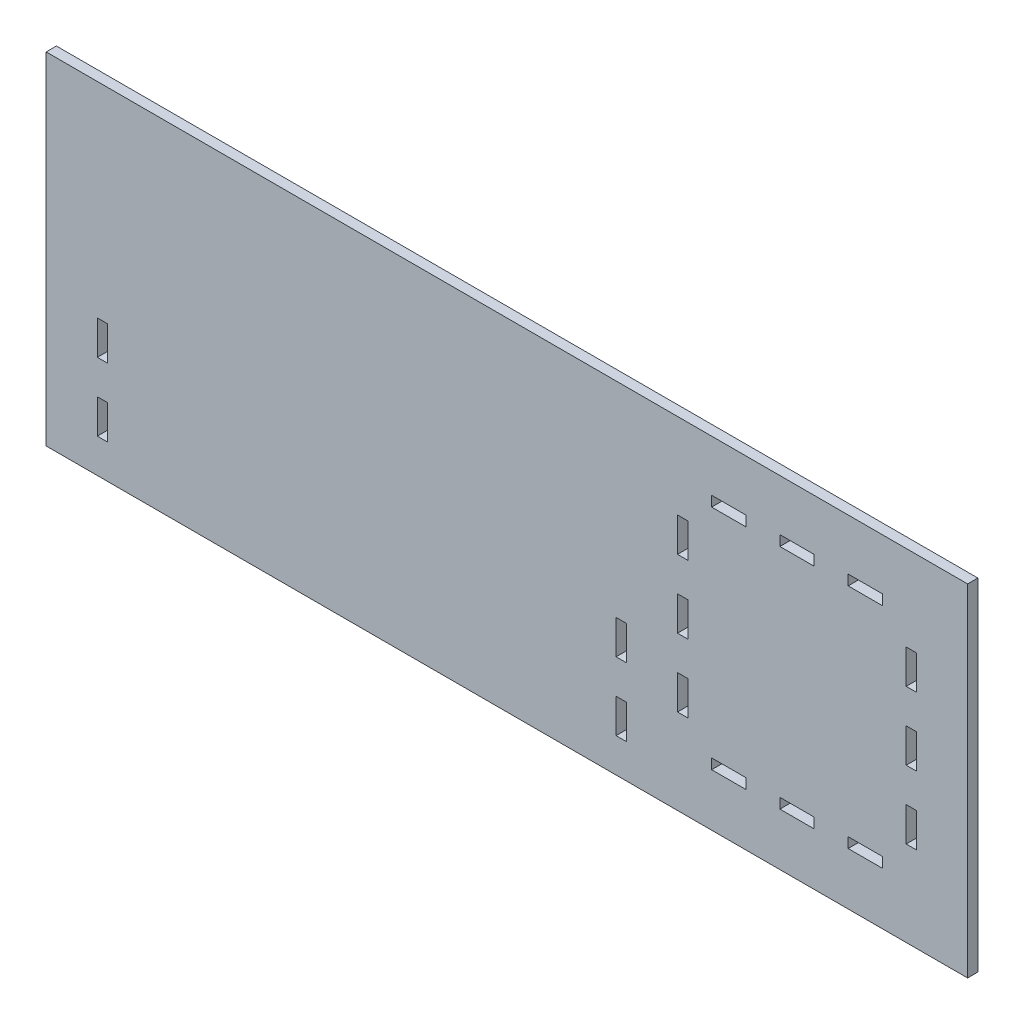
ISO-10303-21;
HEADER;
FILE_DESCRIPTION(('STEP AP214'),'2;1');
FILE_NAME('part.step','',(''),(''),'','','');
FILE_SCHEMA(('AUTOMOTIVE_DESIGN { 1 0 10303 214 1 1 1 1 }'));
ENDSEC;
DATA;
#1=APPLICATION_CONTEXT('core data for automotive mechanical design processes');
#2=APPLICATION_PROTOCOL_DEFINITION('international standard','automotive_design',2000,#1);
#3=PRODUCT_CONTEXT('',#1,'mechanical');
#4=PRODUCT('Part','Part','',(#3));
#5=PRODUCT_RELATED_PRODUCT_CATEGORY('part','',(#4));
#6=PRODUCT_DEFINITION_FORMATION('','',#4);
#7=PRODUCT_DEFINITION_CONTEXT('part definition',#1,'design');
#8=PRODUCT_DEFINITION('design','',#6,#7);
#9=PRODUCT_DEFINITION_SHAPE('','',#8);
#10=(LENGTH_UNIT() NAMED_UNIT(*) SI_UNIT(.MILLI.,.METRE.));
#11=(NAMED_UNIT(*) PLANE_ANGLE_UNIT() SI_UNIT($,.RADIAN.));
#12=(NAMED_UNIT(*) SI_UNIT($,.STERADIAN.) SOLID_ANGLE_UNIT());
#13=UNCERTAINTY_MEASURE_WITH_UNIT(LENGTH_MEASURE(1.E-05),#10,'distance_accuracy_value','');
#14=(GEOMETRIC_REPRESENTATION_CONTEXT(3) GLOBAL_UNCERTAINTY_ASSIGNED_CONTEXT((#13)) GLOBAL_UNIT_ASSIGNED_CONTEXT((#10,
#11,#12)) REPRESENTATION_CONTEXT('',''));
#15=CARTESIAN_POINT('',(0.,0.,0.));
#16=DIRECTION('',(0.,0.,1.));
#17=DIRECTION('',(1.,0.,0.));
#18=AXIS2_PLACEMENT_3D('',#15,#16,#17);
#19=CARTESIAN_POINT('',(135.,50.,3.));
#20=DIRECTION('',(-1.,0.,0.));
#21=DIRECTION('',(0.,0.,1.));
#22=AXIS2_PLACEMENT_3D('',#19,#20,#21);
#23=PLANE('',#22);
#24=DIRECTION('',(0.,1.,0.));
#25=VECTOR('',#24,1.);
#26=CARTESIAN_POINT('',(135.,50.,0.));
#27=LINE('',#26,#25);
#28=CARTESIAN_POINT('',(135.,-50.,0.));
#29=VERTEX_POINT('',#28);
#30=CARTESIAN_POINT('',(135.,50.,0.));
#31=VERTEX_POINT('',#30);
#32=EDGE_CURVE('E966',#29,#31,#27,.T.);
#33=ORIENTED_EDGE('',*,*,#32,.T.);
#34=DIRECTION('',(0.,0.,-1.));
#35=VECTOR('',#34,1.);
#36=CARTESIAN_POINT('',(135.,50.,3.));
#37=LINE('',#36,#35);
#38=CARTESIAN_POINT('',(135.,50.,3.));
#39=VERTEX_POINT('',#38);
#40=EDGE_CURVE('E11',#39,#31,#37,.T.);
#41=ORIENTED_EDGE('',*,*,#40,.F.);
#42=DIRECTION('',(0.,1.,0.));
#43=VECTOR('',#42,1.);
#44=CARTESIAN_POINT('',(135.,50.,3.));
#45=LINE('',#44,#43);
#46=CARTESIAN_POINT('',(135.,-50.,3.));
#47=VERTEX_POINT('',#46);
#48=EDGE_CURVE('E973',#47,#39,#45,.T.);
#49=ORIENTED_EDGE('',*,*,#48,.F.);
#50=DIRECTION('',(0.,0.,-1.));
#51=VECTOR('',#50,1.);
#52=CARTESIAN_POINT('',(135.,-50.,3.));
#53=LINE('',#52,#51);
#54=EDGE_CURVE('E983',#47,#29,#53,.T.);
#55=ORIENTED_EDGE('',*,*,#54,.T.);
#56=EDGE_LOOP('',(#33,#41,#49,#55));
#57=FACE_BOUND('',#56,.T.);
#58=ADVANCED_FACE('F32',(#57),#23,.F.);
#59=CARTESIAN_POINT('',(-135.,50.,3.));
#60=DIRECTION('',(0.,-1.,0.));
#61=DIRECTION('',(0.,0.,-1.));
#62=AXIS2_PLACEMENT_3D('',#59,#60,#61);
#63=PLANE('',#62);
#64=DIRECTION('',(-1.,0.,0.));
#65=VECTOR('',#64,1.);
#66=CARTESIAN_POINT('',(-135.,50.,0.));
#67=LINE('',#66,#65);
#68=CARTESIAN_POINT('',(-135.,50.,0.));
#69=VERTEX_POINT('',#68);
#70=EDGE_CURVE('E986',#31,#69,#67,.T.);
#71=ORIENTED_EDGE('',*,*,#70,.T.);
#72=DIRECTION('',(0.,0.,-1.));
#73=VECTOR('',#72,1.);
#74=CARTESIAN_POINT('',(-135.,50.,3.));
#75=LINE('',#74,#73);
#76=CARTESIAN_POINT('',(-135.,50.,3.));
#77=VERTEX_POINT('',#76);
#78=EDGE_CURVE('E39',#77,#69,#75,.T.);
#79=ORIENTED_EDGE('',*,*,#78,.F.);
#80=DIRECTION('',(-1.,0.,0.));
#81=VECTOR('',#80,1.);
#82=CARTESIAN_POINT('',(-135.,50.,3.));
#83=LINE('',#82,#81);
#84=EDGE_CURVE('E976',#39,#77,#83,.T.);
#85=ORIENTED_EDGE('',*,*,#84,.F.);
#86=ORIENTED_EDGE('',*,*,#40,.T.);
#87=EDGE_LOOP('',(#71,#79,#85,#86));
#88=FACE_BOUND('',#87,.T.);
#89=ADVANCED_FACE('F1015',(#88),#63,.F.);
#90=CARTESIAN_POINT('',(-135.,50.,3.));
#91=DIRECTION('',(1.,0.,0.));
#92=DIRECTION('',(0.,1.,0.));
#93=AXIS2_PLACEMENT_3D('',#90,#91,#92);
#94=PLANE('',#93);
#95=DIRECTION('',(0.,-1.,0.));
#96=VECTOR('',#95,1.);
#97=CARTESIAN_POINT('',(-135.,50.,0.));
#98=LINE('',#97,#96);
#99=CARTESIAN_POINT('',(-135.,-50.,0.));
#100=VERTEX_POINT('',#99);
#101=EDGE_CURVE('E988',#69,#100,#98,.T.);
#102=ORIENTED_EDGE('',*,*,#101,.T.);
#103=DIRECTION('',(0.,0.,-1.));
#104=VECTOR('',#103,1.);
#105=CARTESIAN_POINT('',(-135.,-50.,3.));
#106=LINE('',#105,#104);
#107=CARTESIAN_POINT('',(-135.,-50.,3.));
#108=VERTEX_POINT('',#107);
#109=EDGE_CURVE('E993',#108,#100,#106,.T.);
#110=ORIENTED_EDGE('',*,*,#109,.F.);
#111=DIRECTION('',(0.,-1.,0.));
#112=VECTOR('',#111,1.);
#113=CARTESIAN_POINT('',(-135.,50.,3.));
#114=LINE('',#113,#112);
#115=EDGE_CURVE('E979',#77,#108,#114,.T.);
#116=ORIENTED_EDGE('',*,*,#115,.F.);
#117=ORIENTED_EDGE('',*,*,#78,.T.);
#118=EDGE_LOOP('',(#102,#110,#116,#117));
#119=FACE_BOUND('',#118,.T.);
#120=ADVANCED_FACE('F1000',(#119),#94,.F.);
#121=CARTESIAN_POINT('',(-135.,-50.,3.));
#122=DIRECTION('',(0.,1.,0.));
#123=DIRECTION('',(0.,0.,1.));
#124=AXIS2_PLACEMENT_3D('',#121,#122,#123);
#125=PLANE('',#124);
#126=DIRECTION('',(1.,0.,0.));
#127=VECTOR('',#126,1.);
#128=CARTESIAN_POINT('',(-135.,-50.,0.));
#129=LINE('',#128,#127);
#130=EDGE_CURVE('E977',#100,#29,#129,.T.);
#131=ORIENTED_EDGE('',*,*,#130,.T.);
#132=ORIENTED_EDGE('',*,*,#54,.F.);
#133=DIRECTION('',(1.,0.,0.));
#134=VECTOR('',#133,1.);
#135=CARTESIAN_POINT('',(-135.,-50.,3.));
#136=LINE('',#135,#134);
#137=EDGE_CURVE('E981',#108,#47,#136,.T.);
#138=ORIENTED_EDGE('',*,*,#137,.F.);
#139=ORIENTED_EDGE('',*,*,#109,.T.);
#140=EDGE_LOOP('',(#131,#132,#138,#139));
#141=FACE_BOUND('',#140,.T.);
#142=ADVANCED_FACE('F1008',(#141),#125,.F.);
#143=CARTESIAN_POINT('',(0.,0.,3.));
#144=DIRECTION('',(0.,0.,1.));
#145=DIRECTION('',(1.,0.,0.));
#146=AXIS2_PLACEMENT_3D('',#143,#144,#145);
#147=PLANE('',#146);
#148=DIRECTION('',(0.,-1.,0.));
#149=VECTOR('',#148,1.);
#150=CARTESIAN_POINT('',(32.0000000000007,-30.,3.));
#151=LINE('',#150,#149);
#152=CARTESIAN_POINT('',(32.0000000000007,-30.,3.));
#153=VERTEX_POINT('',#152);
#154=CARTESIAN_POINT('',(32.0000000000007,-40.,3.));
#155=VERTEX_POINT('',#154);
#156=EDGE_CURVE('E46',#153,#155,#151,.T.);
#157=ORIENTED_EDGE('',*,*,#156,.F.);
#158=DIRECTION('',(-1.,0.,0.));
#159=VECTOR('',#158,1.);
#160=CARTESIAN_POINT('',(35.0000000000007,-30.,3.));
#161=LINE('',#160,#159);
#162=CARTESIAN_POINT('',(35.0000000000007,-30.,3.));
#163=VERTEX_POINT('',#162);
#164=EDGE_CURVE('E474',#163,#153,#161,.T.);
#165=ORIENTED_EDGE('',*,*,#164,.F.);
#166=DIRECTION('',(0.,1.,0.));
#167=VECTOR('',#166,1.);
#168=CARTESIAN_POINT('',(35.0000000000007,-30.,3.));
#169=LINE('',#168,#167);
#170=CARTESIAN_POINT('',(35.0000000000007,-40.,3.));
#171=VERTEX_POINT('',#170);
#172=EDGE_CURVE('E477',#171,#163,#169,.T.);
#173=ORIENTED_EDGE('',*,*,#172,.F.);
#174=DIRECTION('',(1.,0.,0.));
#175=VECTOR('',#174,1.);
#176=CARTESIAN_POINT('',(35.0000000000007,-40.,3.));
#177=LINE('',#176,#175);
#178=EDGE_CURVE('E483',#155,#171,#177,.T.);
#179=ORIENTED_EDGE('',*,*,#178,.F.);
#180=EDGE_LOOP('',(#157,#165,#173,#179));
#181=FACE_BOUND('',#180,.T.);
#182=DIRECTION('',(0.,-1.,0.));
#183=VECTOR('',#182,1.);
#184=CARTESIAN_POINT('',(32.0000000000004,-10.,3.));
#185=LINE('',#184,#183);
#186=CARTESIAN_POINT('',(32.0000000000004,-10.,3.));
#187=VERTEX_POINT('',#186);
#188=CARTESIAN_POINT('',(32.0000000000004,-20.,3.));
#189=VERTEX_POINT('',#188);
#190=EDGE_CURVE('E489',#187,#189,#185,.T.);
#191=ORIENTED_EDGE('',*,*,#190,.F.);
#192=DIRECTION('',(-1.,0.,0.));
#193=VECTOR('',#192,1.);
#194=CARTESIAN_POINT('',(35.0000000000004,-10.,3.));
#195=LINE('',#194,#193);
#196=CARTESIAN_POINT('',(35.0000000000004,-10.,3.));
#197=VERTEX_POINT('',#196);
#198=EDGE_CURVE('E497',#197,#187,#195,.T.);
#199=ORIENTED_EDGE('',*,*,#198,.F.);
#200=DIRECTION('',(0.,1.,0.));
#201=VECTOR('',#200,1.);
#202=CARTESIAN_POINT('',(35.0000000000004,-10.,3.));
#203=LINE('',#202,#201);
#204=CARTESIAN_POINT('',(35.0000000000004,-20.,3.));
#205=VERTEX_POINT('',#204);
#206=EDGE_CURVE('E511',#205,#197,#203,.T.);
#207=ORIENTED_EDGE('',*,*,#206,.F.);
#208=DIRECTION('',(1.,0.,0.));
#209=VECTOR('',#208,1.);
#210=CARTESIAN_POINT('',(35.0000000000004,-20.,3.));
#211=LINE('',#210,#209);
#212=EDGE_CURVE('E508',#189,#205,#211,.T.);
#213=ORIENTED_EDGE('',*,*,#212,.F.);
#214=EDGE_LOOP('',(#191,#199,#207,#213));
#215=FACE_BOUND('',#214,.T.);
#216=DIRECTION('',(1.,0.,0.));
#217=VECTOR('',#216,1.);
#218=CARTESIAN_POINT('',(-120.,-40.,3.));
#219=LINE('',#218,#217);
#220=CARTESIAN_POINT('',(-120.,-40.,3.));
#221=VERTEX_POINT('',#220);
#222=CARTESIAN_POINT('',(-117.,-40.,3.));
#223=VERTEX_POINT('',#222);
#224=EDGE_CURVE('E518',#221,#223,#219,.T.);
#225=ORIENTED_EDGE('',*,*,#224,.F.);
#226=DIRECTION('',(0.,-1.,0.));
#227=VECTOR('',#226,1.);
#228=CARTESIAN_POINT('',(-120.,-30.,3.));
#229=LINE('',#228,#227);
#230=CARTESIAN_POINT('',(-120.,-30.,3.));
#231=VERTEX_POINT('',#230);
#232=EDGE_CURVE('E529',#231,#221,#229,.T.);
#233=ORIENTED_EDGE('',*,*,#232,.F.);
#234=DIRECTION('',(-1.,0.,0.));
#235=VECTOR('',#234,1.);
#236=CARTESIAN_POINT('',(-120.,-30.,3.));
#237=LINE('',#236,#235);
#238=CARTESIAN_POINT('',(-117.,-30.,3.));
#239=VERTEX_POINT('',#238);
#240=EDGE_CURVE('E543',#239,#231,#237,.T.);
#241=ORIENTED_EDGE('',*,*,#240,.F.);
#242=DIRECTION('',(0.,1.,0.));
#243=VECTOR('',#242,1.);
#244=CARTESIAN_POINT('',(-117.,-30.,3.));
#245=LINE('',#244,#243);
#246=EDGE_CURVE('E540',#223,#239,#245,.T.);
#247=ORIENTED_EDGE('',*,*,#246,.F.);
#248=EDGE_LOOP('',(#225,#233,#241,#247));
#249=FACE_BOUND('',#248,.T.);
#250=DIRECTION('',(0.,1.,0.));
#251=VECTOR('',#250,1.);
#252=CARTESIAN_POINT('',(-117.,-10.,3.));
#253=LINE('',#252,#251);
#254=CARTESIAN_POINT('',(-117.,-20.,3.));
#255=VERTEX_POINT('',#254);
#256=CARTESIAN_POINT('',(-117.,-10.,3.));
#257=VERTEX_POINT('',#256);
#258=EDGE_CURVE('E550',#255,#257,#253,.T.);
#259=ORIENTED_EDGE('',*,*,#258,.F.);
#260=DIRECTION('',(1.,0.,0.));
#261=VECTOR('',#260,1.);
#262=CARTESIAN_POINT('',(-120.,-20.,3.));
#263=LINE('',#262,#261);
#264=CARTESIAN_POINT('',(-120.,-20.,3.));
#265=VERTEX_POINT('',#264);
#266=EDGE_CURVE('E561',#265,#255,#263,.T.);
#267=ORIENTED_EDGE('',*,*,#266,.F.);
#268=DIRECTION('',(0.,-1.,0.));
#269=VECTOR('',#268,1.);
#270=CARTESIAN_POINT('',(-120.,-10.,3.));
#271=LINE('',#270,#269);
#272=CARTESIAN_POINT('',(-120.,-10.,3.));
#273=VERTEX_POINT('',#272);
#274=EDGE_CURVE('E575',#273,#265,#271,.T.);
#275=ORIENTED_EDGE('',*,*,#274,.F.);
#276=DIRECTION('',(-1.,0.,0.));
#277=VECTOR('',#276,1.);
#278=CARTESIAN_POINT('',(-120.,-10.,3.));
#279=LINE('',#278,#277);
#280=EDGE_CURVE('E572',#257,#273,#279,.T.);
#281=ORIENTED_EDGE('',*,*,#280,.F.);
#282=EDGE_LOOP('',(#259,#267,#275,#281));
#283=FACE_BOUND('',#282,.T.);
#284=DIRECTION('',(1.,0.,0.));
#285=VECTOR('',#284,1.);
#286=CARTESIAN_POINT('',(50.0000000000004,-25.,3.));
#287=LINE('',#286,#285);
#288=CARTESIAN_POINT('',(50.0000000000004,-25.,3.));
#289=VERTEX_POINT('',#288);
#290=CARTESIAN_POINT('',(53.0000000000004,-25.,3.));
#291=VERTEX_POINT('',#290);
#292=EDGE_CURVE('E699',#289,#291,#287,.T.);
#293=ORIENTED_EDGE('',*,*,#292,.F.);
#294=DIRECTION('',(0.,-1.,0.));
#295=VECTOR('',#294,1.);
#296=CARTESIAN_POINT('',(50.0000000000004,-15.,3.));
#297=LINE('',#296,#295);
#298=CARTESIAN_POINT('',(50.0000000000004,-15.,3.));
#299=VERTEX_POINT('',#298);
#300=EDGE_CURVE('E689',#299,#289,#297,.T.);
#301=ORIENTED_EDGE('',*,*,#300,.F.);
#302=DIRECTION('',(-1.,0.,0.));
#303=VECTOR('',#302,1.);
#304=CARTESIAN_POINT('',(50.0000000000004,-15.,3.));
#305=LINE('',#304,#303);
#306=CARTESIAN_POINT('',(53.0000000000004,-15.,3.));
#307=VERTEX_POINT('',#306);
#308=EDGE_CURVE('E705',#307,#299,#305,.T.);
#309=ORIENTED_EDGE('',*,*,#308,.F.);
#310=DIRECTION('',(0.,1.,0.));
#311=VECTOR('',#310,1.);
#312=CARTESIAN_POINT('',(53.0000000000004,-15.,3.));
#313=LINE('',#312,#311);
#314=EDGE_CURVE('E701',#291,#307,#313,.T.);
#315=ORIENTED_EDGE('',*,*,#314,.F.);
#316=EDGE_LOOP('',(#293,#301,#309,#315));
#317=FACE_BOUND('',#316,.T.);
#318=DIRECTION('',(0.,-1.,0.));
#319=VECTOR('',#318,1.);
#320=CARTESIAN_POINT('',(117.,-25.,3.));
#321=LINE('',#320,#319);
#322=CARTESIAN_POINT('',(117.,-15.,3.));
#323=VERTEX_POINT('',#322);
#324=CARTESIAN_POINT('',(117.,-25.,3.));
#325=VERTEX_POINT('',#324);
#326=EDGE_CURVE('E733',#323,#325,#321,.T.);
#327=ORIENTED_EDGE('',*,*,#326,.F.);
#328=DIRECTION('',(-1.,0.,0.));
#329=VECTOR('',#328,1.);
#330=CARTESIAN_POINT('',(120.,-15.,3.));
#331=LINE('',#330,#329);
#332=CARTESIAN_POINT('',(120.,-15.,3.));
#333=VERTEX_POINT('',#332);
#334=EDGE_CURVE('E723',#333,#323,#331,.T.);
#335=ORIENTED_EDGE('',*,*,#334,.F.);
#336=DIRECTION('',(0.,1.,0.));
#337=VECTOR('',#336,1.);
#338=CARTESIAN_POINT('',(120.,-25.,3.));
#339=LINE('',#338,#337);
#340=CARTESIAN_POINT('',(120.,-25.,3.));
#341=VERTEX_POINT('',#340);
#342=EDGE_CURVE('E739',#341,#333,#339,.T.);
#343=ORIENTED_EDGE('',*,*,#342,.F.);
#344=DIRECTION('',(1.,0.,0.));
#345=VECTOR('',#344,1.);
#346=CARTESIAN_POINT('',(120.,-25.,3.));
#347=LINE('',#346,#345);
#348=EDGE_CURVE('E735',#325,#341,#347,.T.);
#349=ORIENTED_EDGE('',*,*,#348,.F.);
#350=EDGE_LOOP('',(#327,#335,#343,#349));
#351=FACE_BOUND('',#350,.T.);
#352=DIRECTION('',(0.,1.,0.));
#353=VECTOR('',#352,1.);
#354=CARTESIAN_POINT('',(90.,-34.6463606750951,3.));
#355=LINE('',#354,#353);
#356=CARTESIAN_POINT('',(90.,-34.6463606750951,3.));
#357=VERTEX_POINT('',#356);
#358=CARTESIAN_POINT('',(90.,-31.6463606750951,3.));
#359=VERTEX_POINT('',#358);
#360=EDGE_CURVE('E616',#357,#359,#355,.T.);
#361=ORIENTED_EDGE('',*,*,#360,.F.);
#362=DIRECTION('',(1.,0.,0.));
#363=VECTOR('',#362,1.);
#364=CARTESIAN_POINT('',(80.,-34.6463606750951,3.));
#365=LINE('',#364,#363);
#366=CARTESIAN_POINT('',(80.,-34.6463606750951,3.));
#367=VERTEX_POINT('',#366);
#368=EDGE_CURVE('E755',#367,#357,#365,.T.);
#369=ORIENTED_EDGE('',*,*,#368,.F.);
#370=DIRECTION('',(0.,-1.,0.));
#371=VECTOR('',#370,1.);
#372=CARTESIAN_POINT('',(80.,-34.6463606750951,3.));
#373=LINE('',#372,#371);
#374=CARTESIAN_POINT('',(80.,-31.6463606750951,3.));
#375=VERTEX_POINT('',#374);
#376=EDGE_CURVE('E769',#375,#367,#373,.T.);
#377=ORIENTED_EDGE('',*,*,#376,.F.);
#378=DIRECTION('',(-1.,0.,0.));
#379=VECTOR('',#378,1.);
#380=CARTESIAN_POINT('',(80.,-31.6463606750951,3.));
#381=LINE('',#380,#379);
#382=EDGE_CURVE('E766',#359,#375,#381,.T.);
#383=ORIENTED_EDGE('',*,*,#382,.F.);
#384=EDGE_LOOP('',(#361,#369,#377,#383));
#385=FACE_BOUND('',#384,.T.);
#386=DIRECTION('',(0.,1.,0.));
#387=VECTOR('',#386,1.);
#388=CARTESIAN_POINT('',(110.,-34.6463606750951,3.));
#389=LINE('',#388,#387);
#390=CARTESIAN_POINT('',(110.,-34.6463606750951,3.));
#391=VERTEX_POINT('',#390);
#392=CARTESIAN_POINT('',(110.,-31.6463606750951,3.));
#393=VERTEX_POINT('',#392);
#394=EDGE_CURVE('E603',#391,#393,#389,.T.);
#395=ORIENTED_EDGE('',*,*,#394,.F.);
#396=DIRECTION('',(1.,0.,0.));
#397=VECTOR('',#396,1.);
#398=CARTESIAN_POINT('',(100.,-34.6463606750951,3.));
#399=LINE('',#398,#397);
#400=CARTESIAN_POINT('',(100.,-34.6463606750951,3.));
#401=VERTEX_POINT('',#400);
#402=EDGE_CURVE('E593',#401,#391,#399,.T.);
#403=ORIENTED_EDGE('',*,*,#402,.F.);
#404=DIRECTION('',(0.,-1.,0.));
#405=VECTOR('',#404,1.);
#406=CARTESIAN_POINT('',(100.,-34.6463606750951,3.));
#407=LINE('',#406,#405);
#408=CARTESIAN_POINT('',(100.,-31.6463606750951,3.));
#409=VERTEX_POINT('',#408);
#410=EDGE_CURVE('E609',#409,#401,#407,.T.);
#411=ORIENTED_EDGE('',*,*,#410,.F.);
#412=DIRECTION('',(-1.,0.,0.));
#413=VECTOR('',#412,1.);
#414=CARTESIAN_POINT('',(100.,-31.6463606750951,3.));
#415=LINE('',#414,#413);
#416=EDGE_CURVE('E605',#393,#409,#415,.T.);
#417=ORIENTED_EDGE('',*,*,#416,.F.);
#418=EDGE_LOOP('',(#395,#403,#411,#417));
#419=FACE_BOUND('',#418,.T.);
#420=DIRECTION('',(-1.,0.,0.));
#421=VECTOR('',#420,1.);
#422=CARTESIAN_POINT('',(120.,4.99999999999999,3.));
#423=LINE('',#422,#421);
#424=CARTESIAN_POINT('',(120.,4.99999999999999,3.));
#425=VERTEX_POINT('',#424);
#426=CARTESIAN_POINT('',(117.,4.99999999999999,3.));
#427=VERTEX_POINT('',#426);
#428=EDGE_CURVE('E637',#425,#427,#423,.T.);
#429=ORIENTED_EDGE('',*,*,#428,.F.);
#430=DIRECTION('',(0.,1.,0.));
#431=VECTOR('',#430,1.);
#432=CARTESIAN_POINT('',(120.,-5.00000000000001,3.));
#433=LINE('',#432,#431);
#434=CARTESIAN_POINT('',(120.,-5.00000000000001,3.));
#435=VERTEX_POINT('',#434);
#436=EDGE_CURVE('E627',#435,#425,#433,.T.);
#437=ORIENTED_EDGE('',*,*,#436,.F.);
#438=DIRECTION('',(1.,0.,0.));
#439=VECTOR('',#438,1.);
#440=CARTESIAN_POINT('',(120.,-5.00000000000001,3.));
#441=LINE('',#440,#439);
#442=CARTESIAN_POINT('',(117.,-5.00000000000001,3.));
#443=VERTEX_POINT('',#442);
#444=EDGE_CURVE('E643',#443,#435,#441,.T.);
#445=ORIENTED_EDGE('',*,*,#444,.F.);
#446=DIRECTION('',(0.,-1.,0.));
#447=VECTOR('',#446,1.);
#448=CARTESIAN_POINT('',(117.,-5.00000000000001,3.));
#449=LINE('',#448,#447);
#450=EDGE_CURVE('E639',#427,#443,#449,.T.);
#451=ORIENTED_EDGE('',*,*,#450,.F.);
#452=EDGE_LOOP('',(#429,#437,#445,#451));
#453=FACE_BOUND('',#452,.T.);
#454=DIRECTION('',(-1.,0.,0.));
#455=VECTOR('',#454,1.);
#456=CARTESIAN_POINT('',(120.,25.,3.));
#457=LINE('',#456,#455);
#458=CARTESIAN_POINT('',(120.,25.,3.));
#459=VERTEX_POINT('',#458);
#460=CARTESIAN_POINT('',(117.,25.,3.));
#461=VERTEX_POINT('',#460);
#462=EDGE_CURVE('E582',#459,#461,#457,.T.);
#463=ORIENTED_EDGE('',*,*,#462,.F.);
#464=DIRECTION('',(0.,1.,0.));
#465=VECTOR('',#464,1.);
#466=CARTESIAN_POINT('',(120.,15.,3.));
#467=LINE('',#466,#465);
#468=CARTESIAN_POINT('',(120.,15.,3.));
#469=VERTEX_POINT('',#468);
#470=EDGE_CURVE('E659',#469,#459,#467,.T.);
#471=ORIENTED_EDGE('',*,*,#470,.F.);
#472=DIRECTION('',(1.,0.,0.));
#473=VECTOR('',#472,1.);
#474=CARTESIAN_POINT('',(120.,15.,3.));
#475=LINE('',#474,#473);
#476=CARTESIAN_POINT('',(117.,15.,3.));
#477=VERTEX_POINT('',#476);
#478=EDGE_CURVE('E673',#477,#469,#475,.T.);
#479=ORIENTED_EDGE('',*,*,#478,.F.);
#480=DIRECTION('',(0.,-1.,0.));
#481=VECTOR('',#480,1.);
#482=CARTESIAN_POINT('',(117.,15.,3.));
#483=LINE('',#482,#481);
#484=EDGE_CURVE('E670',#461,#477,#483,.T.);
#485=ORIENTED_EDGE('',*,*,#484,.F.);
#486=EDGE_LOOP('',(#463,#471,#479,#485));
#487=FACE_BOUND('',#486,.T.);
#488=DIRECTION('',(0.,1.,0.));
#489=VECTOR('',#488,1.);
#490=CARTESIAN_POINT('',(53.,25.,3.));
#491=LINE('',#490,#489);
#492=CARTESIAN_POINT('',(53.,15.,3.));
#493=VERTEX_POINT('',#492);
#494=CARTESIAN_POINT('',(53.,25.,3.));
#495=VERTEX_POINT('',#494);
#496=EDGE_CURVE('E891',#493,#495,#491,.T.);
#497=ORIENTED_EDGE('',*,*,#496,.F.);
#498=DIRECTION('',(1.,0.,0.));
#499=VECTOR('',#498,1.);
#500=CARTESIAN_POINT('',(50.,15.,3.));
#501=LINE('',#500,#499);
#502=CARTESIAN_POINT('',(50.,15.,3.));
#503=VERTEX_POINT('',#502);
#504=EDGE_CURVE('E881',#503,#493,#501,.T.);
#505=ORIENTED_EDGE('',*,*,#504,.F.);
#506=DIRECTION('',(0.,-1.,0.));
#507=VECTOR('',#506,1.);
#508=CARTESIAN_POINT('',(50.,25.,3.));
#509=LINE('',#508,#507);
#510=CARTESIAN_POINT('',(50.,25.,3.));
#511=VERTEX_POINT('',#510);
#512=EDGE_CURVE('E897',#511,#503,#509,.T.);
#513=ORIENTED_EDGE('',*,*,#512,.F.);
#514=DIRECTION('',(-1.,0.,0.));
#515=VECTOR('',#514,1.);
#516=CARTESIAN_POINT('',(50.,25.,3.));
#517=LINE('',#516,#515);
#518=EDGE_CURVE('E893',#495,#511,#517,.T.);
#519=ORIENTED_EDGE('',*,*,#518,.F.);
#520=EDGE_LOOP('',(#497,#505,#513,#519));
#521=FACE_BOUND('',#520,.T.);
#522=DIRECTION('',(0.,1.,0.));
#523=VECTOR('',#522,1.);
#524=CARTESIAN_POINT('',(90.,35.,3.));
#525=LINE('',#524,#523);
#526=CARTESIAN_POINT('',(90.,32.,3.));
#527=VERTEX_POINT('',#526);
#528=CARTESIAN_POINT('',(90.,35.,3.));
#529=VERTEX_POINT('',#528);
#530=EDGE_CURVE('E808',#527,#529,#525,.T.);
#531=ORIENTED_EDGE('',*,*,#530,.F.);
#532=DIRECTION('',(1.,0.,0.));
#533=VECTOR('',#532,1.);
#534=CARTESIAN_POINT('',(80.,32.,3.));
#535=LINE('',#534,#533);
#536=CARTESIAN_POINT('',(80.,32.,3.));
#537=VERTEX_POINT('',#536);
#538=EDGE_CURVE('E915',#537,#527,#535,.T.);
#539=ORIENTED_EDGE('',*,*,#538,.F.);
#540=DIRECTION('',(0.,-1.,0.));
#541=VECTOR('',#540,1.);
#542=CARTESIAN_POINT('',(80.,35.,3.));
#543=LINE('',#542,#541);
#544=CARTESIAN_POINT('',(80.,35.,3.));
#545=VERTEX_POINT('',#544);
#546=EDGE_CURVE('E929',#545,#537,#543,.T.);
#547=ORIENTED_EDGE('',*,*,#546,.F.);
#548=DIRECTION('',(-1.,0.,0.));
#549=VECTOR('',#548,1.);
#550=CARTESIAN_POINT('',(80.,35.,3.));
#551=LINE('',#550,#549);
#552=EDGE_CURVE('E926',#529,#545,#551,.T.);
#553=ORIENTED_EDGE('',*,*,#552,.F.);
#554=EDGE_LOOP('',(#531,#539,#547,#553));
#555=FACE_BOUND('',#554,.T.);
#556=DIRECTION('',(0.,1.,0.));
#557=VECTOR('',#556,1.);
#558=CARTESIAN_POINT('',(110.,35.,3.));
#559=LINE('',#558,#557);
#560=CARTESIAN_POINT('',(110.,32.,3.));
#561=VERTEX_POINT('',#560);
#562=CARTESIAN_POINT('',(110.,35.,3.));
#563=VERTEX_POINT('',#562);
#564=EDGE_CURVE('E795',#561,#563,#559,.T.);
#565=ORIENTED_EDGE('',*,*,#564,.F.);
#566=DIRECTION('',(1.,0.,0.));
#567=VECTOR('',#566,1.);
#568=CARTESIAN_POINT('',(100.,32.,3.));
#569=LINE('',#568,#567);
#570=CARTESIAN_POINT('',(100.,32.,3.));
#571=VERTEX_POINT('',#570);
#572=EDGE_CURVE('E785',#571,#561,#569,.T.);
#573=ORIENTED_EDGE('',*,*,#572,.F.);
#574=DIRECTION('',(0.,-1.,0.));
#575=VECTOR('',#574,1.);
#576=CARTESIAN_POINT('',(100.,35.,3.));
#577=LINE('',#576,#575);
#578=CARTESIAN_POINT('',(100.,35.,3.));
#579=VERTEX_POINT('',#578);
#580=EDGE_CURVE('E801',#579,#571,#577,.T.);
#581=ORIENTED_EDGE('',*,*,#580,.F.);
#582=DIRECTION('',(-1.,0.,0.));
#583=VECTOR('',#582,1.);
#584=CARTESIAN_POINT('',(100.,35.,3.));
#585=LINE('',#584,#583);
#586=EDGE_CURVE('E797',#563,#579,#585,.T.);
#587=ORIENTED_EDGE('',*,*,#586,.F.);
#588=EDGE_LOOP('',(#565,#573,#581,#587));
#589=FACE_BOUND('',#588,.T.);
#590=DIRECTION('',(0.,1.,0.));
#591=VECTOR('',#590,1.);
#592=CARTESIAN_POINT('',(70.,-34.6463606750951,3.));
#593=LINE('',#592,#591);
#594=CARTESIAN_POINT('',(70.,-34.6463606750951,3.));
#595=VERTEX_POINT('',#594);
#596=CARTESIAN_POINT('',(70.,-31.6463606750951,3.));
#597=VERTEX_POINT('',#596);
#598=EDGE_CURVE('E829',#595,#597,#593,.T.);
#599=ORIENTED_EDGE('',*,*,#598,.F.);
#600=DIRECTION('',(1.,0.,0.));
#601=VECTOR('',#600,1.);
#602=CARTESIAN_POINT('',(60.,-34.6463606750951,3.));
#603=LINE('',#602,#601);
#604=CARTESIAN_POINT('',(60.,-34.6463606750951,3.));
#605=VERTEX_POINT('',#604);
#606=EDGE_CURVE('E819',#605,#595,#603,.T.);
#607=ORIENTED_EDGE('',*,*,#606,.F.);
#608=DIRECTION('',(0.,-1.,0.));
#609=VECTOR('',#608,1.);
#610=CARTESIAN_POINT('',(60.,-34.6463606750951,3.));
#611=LINE('',#610,#609);
#612=CARTESIAN_POINT('',(60.,-31.6463606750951,3.));
#613=VERTEX_POINT('',#612);
#614=EDGE_CURVE('E835',#613,#605,#611,.T.);
#615=ORIENTED_EDGE('',*,*,#614,.F.);
#616=DIRECTION('',(-1.,0.,0.));
#617=VECTOR('',#616,1.);
#618=CARTESIAN_POINT('',(60.,-31.6463606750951,3.));
#619=LINE('',#618,#617);
#620=EDGE_CURVE('E831',#597,#613,#619,.T.);
#621=ORIENTED_EDGE('',*,*,#620,.F.);
#622=EDGE_LOOP('',(#599,#607,#615,#621));
#623=FACE_BOUND('',#622,.T.);
#624=DIRECTION('',(1.,0.,0.));
#625=VECTOR('',#624,1.);
#626=CARTESIAN_POINT('',(50.0000000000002,-5.00000000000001,3.));
#627=LINE('',#626,#625);
#628=CARTESIAN_POINT('',(50.0000000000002,-5.00000000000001,3.));
#629=VERTEX_POINT('',#628);
#630=CARTESIAN_POINT('',(53.0000000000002,-5.00000000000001,3.));
#631=VERTEX_POINT('',#630);
#632=EDGE_CURVE('E712',#629,#631,#627,.T.);
#633=ORIENTED_EDGE('',*,*,#632,.F.);
#634=DIRECTION('',(0.,-1.,0.));
#635=VECTOR('',#634,1.);
#636=CARTESIAN_POINT('',(50.0000000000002,4.99999999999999,3.));
#637=LINE('',#636,#635);
#638=CARTESIAN_POINT('',(50.0000000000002,4.99999999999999,3.));
#639=VERTEX_POINT('',#638);
#640=EDGE_CURVE('E851',#639,#629,#637,.T.);
#641=ORIENTED_EDGE('',*,*,#640,.F.);
#642=DIRECTION('',(-1.,0.,0.));
#643=VECTOR('',#642,1.);
#644=CARTESIAN_POINT('',(50.0000000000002,4.99999999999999,3.));
#645=LINE('',#644,#643);
#646=CARTESIAN_POINT('',(53.0000000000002,4.99999999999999,3.));
#647=VERTEX_POINT('',#646);
#648=EDGE_CURVE('E865',#647,#639,#645,.T.);
#649=ORIENTED_EDGE('',*,*,#648,.F.);
#650=DIRECTION('',(0.,1.,0.));
#651=VECTOR('',#650,1.);
#652=CARTESIAN_POINT('',(53.0000000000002,4.99999999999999,3.));
#653=LINE('',#652,#651);
#654=EDGE_CURVE('E862',#631,#647,#653,.T.);
#655=ORIENTED_EDGE('',*,*,#654,.F.);
#656=EDGE_LOOP('',(#633,#641,#649,#655));
#657=FACE_BOUND('',#656,.T.);
#658=DIRECTION('',(0.,1.,0.));
#659=VECTOR('',#658,1.);
#660=CARTESIAN_POINT('',(70.,35.,3.));
#661=LINE('',#660,#659);
#662=CARTESIAN_POINT('',(70.,32.,3.));
#663=VERTEX_POINT('',#662);
#664=CARTESIAN_POINT('',(70.,35.,3.));
#665=VERTEX_POINT('',#664);
#666=EDGE_CURVE('E904',#663,#665,#661,.T.);
#667=ORIENTED_EDGE('',*,*,#666,.F.);
#668=DIRECTION('',(1.,0.,0.));
#669=VECTOR('',#668,1.);
#670=CARTESIAN_POINT('',(60.,32.,3.));
#671=LINE('',#670,#669);
#672=CARTESIAN_POINT('',(60.,32.,3.));
#673=VERTEX_POINT('',#672);
#674=EDGE_CURVE('E945',#673,#663,#671,.T.);
#675=ORIENTED_EDGE('',*,*,#674,.F.);
#676=DIRECTION('',(0.,-1.,0.));
#677=VECTOR('',#676,1.);
#678=CARTESIAN_POINT('',(60.,35.,3.));
#679=LINE('',#678,#677);
#680=CARTESIAN_POINT('',(60.,35.,3.));
#681=VERTEX_POINT('',#680);
#682=EDGE_CURVE('E959',#681,#673,#679,.T.);
#683=ORIENTED_EDGE('',*,*,#682,.F.);
#684=DIRECTION('',(-1.,0.,0.));
#685=VECTOR('',#684,1.);
#686=CARTESIAN_POINT('',(60.,35.,3.));
#687=LINE('',#686,#685);
#688=EDGE_CURVE('E956',#665,#681,#687,.T.);
#689=ORIENTED_EDGE('',*,*,#688,.F.);
#690=EDGE_LOOP('',(#667,#675,#683,#689));
#691=FACE_BOUND('',#690,.T.);
#692=ORIENTED_EDGE('',*,*,#48,.T.);
#693=ORIENTED_EDGE('',*,*,#84,.T.);
#694=ORIENTED_EDGE('',*,*,#115,.T.);
#695=ORIENTED_EDGE('',*,*,#137,.T.);
#696=EDGE_LOOP('',(#692,#693,#694,#695));
#697=FACE_BOUND('',#696,.T.);
#698=ADVANCED_FACE('F1014',(#181,#215,#249,#283,#317,#351,#385,#419,#453,#487,#521,#555,#589,
#623,#657,#691,#697),#147,.T.);
#699=CARTESIAN_POINT('',(0.,0.,0.));
#700=DIRECTION('',(0.,0.,1.));
#701=DIRECTION('',(1.,0.,0.));
#702=AXIS2_PLACEMENT_3D('',#699,#700,#701);
#703=PLANE('',#702);
#704=DIRECTION('',(-1.,0.,0.));
#705=VECTOR('',#704,1.);
#706=CARTESIAN_POINT('',(35.0000000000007,-30.,0.));
#707=LINE('',#706,#705);
#708=CARTESIAN_POINT('',(35.0000000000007,-30.,0.));
#709=VERTEX_POINT('',#708);
#710=CARTESIAN_POINT('',(32.0000000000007,-30.,0.));
#711=VERTEX_POINT('',#710);
#712=EDGE_CURVE('E464',#709,#711,#707,.T.);
#713=ORIENTED_EDGE('',*,*,#712,.T.);
#714=DIRECTION('',(0.,-1.,0.));
#715=VECTOR('',#714,1.);
#716=CARTESIAN_POINT('',(32.0000000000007,-30.,0.));
#717=LINE('',#716,#715);
#718=CARTESIAN_POINT('',(32.0000000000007,-40.,0.));
#719=VERTEX_POINT('',#718);
#720=EDGE_CURVE('E458',#711,#719,#717,.T.);
#721=ORIENTED_EDGE('',*,*,#720,.T.);
#722=DIRECTION('',(1.,0.,0.));
#723=VECTOR('',#722,1.);
#724=CARTESIAN_POINT('',(35.0000000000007,-40.,0.));
#725=LINE('',#724,#723);
#726=CARTESIAN_POINT('',(35.0000000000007,-40.,0.));
#727=VERTEX_POINT('',#726);
#728=EDGE_CURVE('E467',#719,#727,#725,.T.);
#729=ORIENTED_EDGE('',*,*,#728,.T.);
#730=DIRECTION('',(0.,1.,0.));
#731=VECTOR('',#730,1.);
#732=CARTESIAN_POINT('',(35.0000000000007,-30.,0.));
#733=LINE('',#732,#731);
#734=EDGE_CURVE('E54',#727,#709,#733,.T.);
#735=ORIENTED_EDGE('',*,*,#734,.T.);
#736=EDGE_LOOP('',(#713,#721,#729,#735));
#737=FACE_BOUND('',#736,.T.);
#738=DIRECTION('',(-1.,0.,0.));
#739=VECTOR('',#738,1.);
#740=CARTESIAN_POINT('',(35.0000000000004,-10.,0.));
#741=LINE('',#740,#739);
#742=CARTESIAN_POINT('',(35.0000000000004,-10.,0.));
#743=VERTEX_POINT('',#742);
#744=CARTESIAN_POINT('',(32.0000000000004,-10.,0.));
#745=VERTEX_POINT('',#744);
#746=EDGE_CURVE('E503',#743,#745,#741,.T.);
#747=ORIENTED_EDGE('',*,*,#746,.T.);
#748=DIRECTION('',(0.,-1.,0.));
#749=VECTOR('',#748,1.);
#750=CARTESIAN_POINT('',(32.0000000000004,-10.,0.));
#751=LINE('',#750,#749);
#752=CARTESIAN_POINT('',(32.0000000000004,-20.,0.));
#753=VERTEX_POINT('',#752);
#754=EDGE_CURVE('E493',#745,#753,#751,.T.);
#755=ORIENTED_EDGE('',*,*,#754,.T.);
#756=DIRECTION('',(1.,0.,0.));
#757=VECTOR('',#756,1.);
#758=CARTESIAN_POINT('',(35.0000000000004,-20.,0.));
#759=LINE('',#758,#757);
#760=CARTESIAN_POINT('',(35.0000000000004,-20.,0.));
#761=VERTEX_POINT('',#760);
#762=EDGE_CURVE('E496',#753,#761,#759,.T.);
#763=ORIENTED_EDGE('',*,*,#762,.T.);
#764=DIRECTION('',(0.,1.,0.));
#765=VECTOR('',#764,1.);
#766=CARTESIAN_POINT('',(35.0000000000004,-10.,0.));
#767=LINE('',#766,#765);
#768=EDGE_CURVE('E500',#761,#743,#767,.T.);
#769=ORIENTED_EDGE('',*,*,#768,.T.);
#770=EDGE_LOOP('',(#747,#755,#763,#769));
#771=FACE_BOUND('',#770,.T.);
#772=DIRECTION('',(0.,-1.,0.));
#773=VECTOR('',#772,1.);
#774=CARTESIAN_POINT('',(-120.,-30.,0.));
#775=LINE('',#774,#773);
#776=CARTESIAN_POINT('',(-120.,-30.,0.));
#777=VERTEX_POINT('',#776);
#778=CARTESIAN_POINT('',(-120.,-40.,0.));
#779=VERTEX_POINT('',#778);
#780=EDGE_CURVE('E535',#777,#779,#775,.T.);
#781=ORIENTED_EDGE('',*,*,#780,.T.);
#782=DIRECTION('',(1.,0.,0.));
#783=VECTOR('',#782,1.);
#784=CARTESIAN_POINT('',(-120.,-40.,0.));
#785=LINE('',#784,#783);
#786=CARTESIAN_POINT('',(-117.,-40.,0.));
#787=VERTEX_POINT('',#786);
#788=EDGE_CURVE('E525',#779,#787,#785,.T.);
#789=ORIENTED_EDGE('',*,*,#788,.T.);
#790=DIRECTION('',(0.,1.,0.));
#791=VECTOR('',#790,1.);
#792=CARTESIAN_POINT('',(-117.,-30.,0.));
#793=LINE('',#792,#791);
#794=CARTESIAN_POINT('',(-117.,-30.,0.));
#795=VERTEX_POINT('',#794);
#796=EDGE_CURVE('E528',#787,#795,#793,.T.);
#797=ORIENTED_EDGE('',*,*,#796,.T.);
#798=DIRECTION('',(-1.,0.,0.));
#799=VECTOR('',#798,1.);
#800=CARTESIAN_POINT('',(-120.,-30.,0.));
#801=LINE('',#800,#799);
#802=EDGE_CURVE('E532',#795,#777,#801,.T.);
#803=ORIENTED_EDGE('',*,*,#802,.T.);
#804=EDGE_LOOP('',(#781,#789,#797,#803));
#805=FACE_BOUND('',#804,.T.);
#806=DIRECTION('',(1.,0.,0.));
#807=VECTOR('',#806,1.);
#808=CARTESIAN_POINT('',(-120.,-20.,0.));
#809=LINE('',#808,#807);
#810=CARTESIAN_POINT('',(-120.,-20.,0.));
#811=VERTEX_POINT('',#810);
#812=CARTESIAN_POINT('',(-117.,-20.,0.));
#813=VERTEX_POINT('',#812);
#814=EDGE_CURVE('E567',#811,#813,#809,.T.);
#815=ORIENTED_EDGE('',*,*,#814,.T.);
#816=DIRECTION('',(0.,1.,0.));
#817=VECTOR('',#816,1.);
#818=CARTESIAN_POINT('',(-117.,-10.,0.));
#819=LINE('',#818,#817);
#820=CARTESIAN_POINT('',(-117.,-10.,0.));
#821=VERTEX_POINT('',#820);
#822=EDGE_CURVE('E557',#813,#821,#819,.T.);
#823=ORIENTED_EDGE('',*,*,#822,.T.);
#824=DIRECTION('',(-1.,0.,0.));
#825=VECTOR('',#824,1.);
#826=CARTESIAN_POINT('',(-120.,-10.,0.));
#827=LINE('',#826,#825);
#828=CARTESIAN_POINT('',(-120.,-10.,0.));
#829=VERTEX_POINT('',#828);
#830=EDGE_CURVE('E560',#821,#829,#827,.T.);
#831=ORIENTED_EDGE('',*,*,#830,.T.);
#832=DIRECTION('',(0.,-1.,0.));
#833=VECTOR('',#832,1.);
#834=CARTESIAN_POINT('',(-120.,-10.,0.));
#835=LINE('',#834,#833);
#836=EDGE_CURVE('E564',#829,#811,#835,.T.);
#837=ORIENTED_EDGE('',*,*,#836,.T.);
#838=EDGE_LOOP('',(#815,#823,#831,#837));
#839=FACE_BOUND('',#838,.T.);
#840=DIRECTION('',(0.,-1.,0.));
#841=VECTOR('',#840,1.);
#842=CARTESIAN_POINT('',(50.0000000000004,-15.,0.));
#843=LINE('',#842,#841);
#844=CARTESIAN_POINT('',(50.0000000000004,-15.,0.));
#845=VERTEX_POINT('',#844);
#846=CARTESIAN_POINT('',(50.0000000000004,-25.,0.));
#847=VERTEX_POINT('',#846);
#848=EDGE_CURVE('E695',#845,#847,#843,.T.);
#849=ORIENTED_EDGE('',*,*,#848,.T.);
#850=DIRECTION('',(1.,0.,0.));
#851=VECTOR('',#850,1.);
#852=CARTESIAN_POINT('',(50.0000000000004,-25.,0.));
#853=LINE('',#852,#851);
#854=CARTESIAN_POINT('',(53.0000000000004,-25.,0.));
#855=VERTEX_POINT('',#854);
#856=EDGE_CURVE('E685',#847,#855,#853,.T.);
#857=ORIENTED_EDGE('',*,*,#856,.T.);
#858=DIRECTION('',(0.,1.,0.));
#859=VECTOR('',#858,1.);
#860=CARTESIAN_POINT('',(53.0000000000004,-15.,0.));
#861=LINE('',#860,#859);
#862=CARTESIAN_POINT('',(53.0000000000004,-15.,0.));
#863=VERTEX_POINT('',#862);
#864=EDGE_CURVE('E688',#855,#863,#861,.T.);
#865=ORIENTED_EDGE('',*,*,#864,.T.);
#866=DIRECTION('',(-1.,0.,0.));
#867=VECTOR('',#866,1.);
#868=CARTESIAN_POINT('',(50.0000000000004,-15.,0.));
#869=LINE('',#868,#867);
#870=EDGE_CURVE('E692',#863,#845,#869,.T.);
#871=ORIENTED_EDGE('',*,*,#870,.T.);
#872=EDGE_LOOP('',(#849,#857,#865,#871));
#873=FACE_BOUND('',#872,.T.);
#874=DIRECTION('',(-1.,0.,0.));
#875=VECTOR('',#874,1.);
#876=CARTESIAN_POINT('',(120.,-15.,0.));
#877=LINE('',#876,#875);
#878=CARTESIAN_POINT('',(120.,-15.,0.));
#879=VERTEX_POINT('',#878);
#880=CARTESIAN_POINT('',(117.,-15.,0.));
#881=VERTEX_POINT('',#880);
#882=EDGE_CURVE('E729',#879,#881,#877,.T.);
#883=ORIENTED_EDGE('',*,*,#882,.T.);
#884=DIRECTION('',(0.,-1.,0.));
#885=VECTOR('',#884,1.);
#886=CARTESIAN_POINT('',(117.,-25.,0.));
#887=LINE('',#886,#885);
#888=CARTESIAN_POINT('',(117.,-25.,0.));
#889=VERTEX_POINT('',#888);
#890=EDGE_CURVE('E719',#881,#889,#887,.T.);
#891=ORIENTED_EDGE('',*,*,#890,.T.);
#892=DIRECTION('',(1.,0.,0.));
#893=VECTOR('',#892,1.);
#894=CARTESIAN_POINT('',(120.,-25.,0.));
#895=LINE('',#894,#893);
#896=CARTESIAN_POINT('',(120.,-25.,0.));
#897=VERTEX_POINT('',#896);
#898=EDGE_CURVE('E722',#889,#897,#895,.T.);
#899=ORIENTED_EDGE('',*,*,#898,.T.);
#900=DIRECTION('',(0.,1.,0.));
#901=VECTOR('',#900,1.);
#902=CARTESIAN_POINT('',(120.,-25.,0.));
#903=LINE('',#902,#901);
#904=EDGE_CURVE('E726',#897,#879,#903,.T.);
#905=ORIENTED_EDGE('',*,*,#904,.T.);
#906=EDGE_LOOP('',(#883,#891,#899,#905));
#907=FACE_BOUND('',#906,.T.);
#908=DIRECTION('',(1.,0.,0.));
#909=VECTOR('',#908,1.);
#910=CARTESIAN_POINT('',(80.,-34.6463606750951,0.));
#911=LINE('',#910,#909);
#912=CARTESIAN_POINT('',(80.,-34.6463606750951,0.));
#913=VERTEX_POINT('',#912);
#914=CARTESIAN_POINT('',(90.,-34.6463606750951,0.));
#915=VERTEX_POINT('',#914);
#916=EDGE_CURVE('E761',#913,#915,#911,.T.);
#917=ORIENTED_EDGE('',*,*,#916,.T.);
#918=DIRECTION('',(0.,1.,0.));
#919=VECTOR('',#918,1.);
#920=CARTESIAN_POINT('',(90.,-34.6463606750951,0.));
#921=LINE('',#920,#919);
#922=CARTESIAN_POINT('',(90.,-31.6463606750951,0.));
#923=VERTEX_POINT('',#922);
#924=EDGE_CURVE('E751',#915,#923,#921,.T.);
#925=ORIENTED_EDGE('',*,*,#924,.T.);
#926=DIRECTION('',(-1.,0.,0.));
#927=VECTOR('',#926,1.);
#928=CARTESIAN_POINT('',(80.,-31.6463606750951,0.));
#929=LINE('',#928,#927);
#930=CARTESIAN_POINT('',(80.,-31.6463606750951,0.));
#931=VERTEX_POINT('',#930);
#932=EDGE_CURVE('E754',#923,#931,#929,.T.);
#933=ORIENTED_EDGE('',*,*,#932,.T.);
#934=DIRECTION('',(0.,-1.,0.));
#935=VECTOR('',#934,1.);
#936=CARTESIAN_POINT('',(80.,-34.6463606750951,0.));
#937=LINE('',#936,#935);
#938=EDGE_CURVE('E758',#931,#913,#937,.T.);
#939=ORIENTED_EDGE('',*,*,#938,.T.);
#940=EDGE_LOOP('',(#917,#925,#933,#939));
#941=FACE_BOUND('',#940,.T.);
#942=DIRECTION('',(1.,0.,0.));
#943=VECTOR('',#942,1.);
#944=CARTESIAN_POINT('',(100.,-34.6463606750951,0.));
#945=LINE('',#944,#943);
#946=CARTESIAN_POINT('',(100.,-34.6463606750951,0.));
#947=VERTEX_POINT('',#946);
#948=CARTESIAN_POINT('',(110.,-34.6463606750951,0.));
#949=VERTEX_POINT('',#948);
#950=EDGE_CURVE('E599',#947,#949,#945,.T.);
#951=ORIENTED_EDGE('',*,*,#950,.T.);
#952=DIRECTION('',(0.,1.,0.));
#953=VECTOR('',#952,1.);
#954=CARTESIAN_POINT('',(110.,-34.6463606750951,0.));
#955=LINE('',#954,#953);
#956=CARTESIAN_POINT('',(110.,-31.6463606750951,0.));
#957=VERTEX_POINT('',#956);
#958=EDGE_CURVE('E589',#949,#957,#955,.T.);
#959=ORIENTED_EDGE('',*,*,#958,.T.);
#960=DIRECTION('',(-1.,0.,0.));
#961=VECTOR('',#960,1.);
#962=CARTESIAN_POINT('',(100.,-31.6463606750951,0.));
#963=LINE('',#962,#961);
#964=CARTESIAN_POINT('',(100.,-31.6463606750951,0.));
#965=VERTEX_POINT('',#964);
#966=EDGE_CURVE('E592',#957,#965,#963,.T.);
#967=ORIENTED_EDGE('',*,*,#966,.T.);
#968=DIRECTION('',(0.,-1.,0.));
#969=VECTOR('',#968,1.);
#970=CARTESIAN_POINT('',(100.,-34.6463606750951,0.));
#971=LINE('',#970,#969);
#972=EDGE_CURVE('E596',#965,#947,#971,.T.);
#973=ORIENTED_EDGE('',*,*,#972,.T.);
#974=EDGE_LOOP('',(#951,#959,#967,#973));
#975=FACE_BOUND('',#974,.T.);
#976=DIRECTION('',(0.,1.,0.));
#977=VECTOR('',#976,1.);
#978=CARTESIAN_POINT('',(120.,-5.00000000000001,0.));
#979=LINE('',#978,#977);
#980=CARTESIAN_POINT('',(120.,-5.00000000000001,0.));
#981=VERTEX_POINT('',#980);
#982=CARTESIAN_POINT('',(120.,4.99999999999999,0.));
#983=VERTEX_POINT('',#982);
#984=EDGE_CURVE('E633',#981,#983,#979,.T.);
#985=ORIENTED_EDGE('',*,*,#984,.T.);
#986=DIRECTION('',(-1.,0.,0.));
#987=VECTOR('',#986,1.);
#988=CARTESIAN_POINT('',(120.,4.99999999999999,0.));
#989=LINE('',#988,#987);
#990=CARTESIAN_POINT('',(117.,4.99999999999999,0.));
#991=VERTEX_POINT('',#990);
#992=EDGE_CURVE('E623',#983,#991,#989,.T.);
#993=ORIENTED_EDGE('',*,*,#992,.T.);
#994=DIRECTION('',(0.,-1.,0.));
#995=VECTOR('',#994,1.);
#996=CARTESIAN_POINT('',(117.,-5.00000000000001,0.));
#997=LINE('',#996,#995);
#998=CARTESIAN_POINT('',(117.,-5.00000000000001,0.));
#999=VERTEX_POINT('',#998);
#1000=EDGE_CURVE('E626',#991,#999,#997,.T.);
#1001=ORIENTED_EDGE('',*,*,#1000,.T.);
#1002=DIRECTION('',(1.,0.,0.));
#1003=VECTOR('',#1002,1.);
#1004=CARTESIAN_POINT('',(120.,-5.00000000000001,0.));
#1005=LINE('',#1004,#1003);
#1006=EDGE_CURVE('E630',#999,#981,#1005,.T.);
#1007=ORIENTED_EDGE('',*,*,#1006,.T.);
#1008=EDGE_LOOP('',(#985,#993,#1001,#1007));
#1009=FACE_BOUND('',#1008,.T.);
#1010=DIRECTION('',(0.,1.,0.));
#1011=VECTOR('',#1010,1.);
#1012=CARTESIAN_POINT('',(120.,15.,0.));
#1013=LINE('',#1012,#1011);
#1014=CARTESIAN_POINT('',(120.,15.,0.));
#1015=VERTEX_POINT('',#1014);
#1016=CARTESIAN_POINT('',(120.,25.,0.));
#1017=VERTEX_POINT('',#1016);
#1018=EDGE_CURVE('E665',#1015,#1017,#1013,.T.);
#1019=ORIENTED_EDGE('',*,*,#1018,.T.);
#1020=DIRECTION('',(-1.,0.,0.));
#1021=VECTOR('',#1020,1.);
#1022=CARTESIAN_POINT('',(120.,25.,0.));
#1023=LINE('',#1022,#1021);
#1024=CARTESIAN_POINT('',(117.,25.,0.));
#1025=VERTEX_POINT('',#1024);
#1026=EDGE_CURVE('E655',#1017,#1025,#1023,.T.);
#1027=ORIENTED_EDGE('',*,*,#1026,.T.);
#1028=DIRECTION('',(0.,-1.,0.));
#1029=VECTOR('',#1028,1.);
#1030=CARTESIAN_POINT('',(117.,15.,0.));
#1031=LINE('',#1030,#1029);
#1032=CARTESIAN_POINT('',(117.,15.,0.));
#1033=VERTEX_POINT('',#1032);
#1034=EDGE_CURVE('E658',#1025,#1033,#1031,.T.);
#1035=ORIENTED_EDGE('',*,*,#1034,.T.);
#1036=DIRECTION('',(1.,0.,0.));
#1037=VECTOR('',#1036,1.);
#1038=CARTESIAN_POINT('',(120.,15.,0.));
#1039=LINE('',#1038,#1037);
#1040=EDGE_CURVE('E662',#1033,#1015,#1039,.T.);
#1041=ORIENTED_EDGE('',*,*,#1040,.T.);
#1042=EDGE_LOOP('',(#1019,#1027,#1035,#1041));
#1043=FACE_BOUND('',#1042,.T.);
#1044=DIRECTION('',(1.,0.,0.));
#1045=VECTOR('',#1044,1.);
#1046=CARTESIAN_POINT('',(50.,15.,0.));
#1047=LINE('',#1046,#1045);
#1048=CARTESIAN_POINT('',(50.,15.,0.));
#1049=VERTEX_POINT('',#1048);
#1050=CARTESIAN_POINT('',(53.,15.,0.));
#1051=VERTEX_POINT('',#1050);
#1052=EDGE_CURVE('E887',#1049,#1051,#1047,.T.);
#1053=ORIENTED_EDGE('',*,*,#1052,.T.);
#1054=DIRECTION('',(0.,1.,0.));
#1055=VECTOR('',#1054,1.);
#1056=CARTESIAN_POINT('',(53.,25.,0.));
#1057=LINE('',#1056,#1055);
#1058=CARTESIAN_POINT('',(53.,25.,0.));
#1059=VERTEX_POINT('',#1058);
#1060=EDGE_CURVE('E877',#1051,#1059,#1057,.T.);
#1061=ORIENTED_EDGE('',*,*,#1060,.T.);
#1062=DIRECTION('',(-1.,0.,0.));
#1063=VECTOR('',#1062,1.);
#1064=CARTESIAN_POINT('',(50.,25.,0.));
#1065=LINE('',#1064,#1063);
#1066=CARTESIAN_POINT('',(50.,25.,0.));
#1067=VERTEX_POINT('',#1066);
#1068=EDGE_CURVE('E880',#1059,#1067,#1065,.T.);
#1069=ORIENTED_EDGE('',*,*,#1068,.T.);
#1070=DIRECTION('',(0.,-1.,0.));
#1071=VECTOR('',#1070,1.);
#1072=CARTESIAN_POINT('',(50.,25.,0.));
#1073=LINE('',#1072,#1071);
#1074=EDGE_CURVE('E884',#1067,#1049,#1073,.T.);
#1075=ORIENTED_EDGE('',*,*,#1074,.T.);
#1076=EDGE_LOOP('',(#1053,#1061,#1069,#1075));
#1077=FACE_BOUND('',#1076,.T.);
#1078=DIRECTION('',(1.,0.,0.));
#1079=VECTOR('',#1078,1.);
#1080=CARTESIAN_POINT('',(80.,32.,0.));
#1081=LINE('',#1080,#1079);
#1082=CARTESIAN_POINT('',(80.,32.,0.));
#1083=VERTEX_POINT('',#1082);
#1084=CARTESIAN_POINT('',(90.,32.,0.));
#1085=VERTEX_POINT('',#1084);
#1086=EDGE_CURVE('E921',#1083,#1085,#1081,.T.);
#1087=ORIENTED_EDGE('',*,*,#1086,.T.);
#1088=DIRECTION('',(0.,1.,0.));
#1089=VECTOR('',#1088,1.);
#1090=CARTESIAN_POINT('',(90.,35.,0.));
#1091=LINE('',#1090,#1089);
#1092=CARTESIAN_POINT('',(90.,35.,0.));
#1093=VERTEX_POINT('',#1092);
#1094=EDGE_CURVE('E911',#1085,#1093,#1091,.T.);
#1095=ORIENTED_EDGE('',*,*,#1094,.T.);
#1096=DIRECTION('',(-1.,0.,0.));
#1097=VECTOR('',#1096,1.);
#1098=CARTESIAN_POINT('',(80.,35.,0.));
#1099=LINE('',#1098,#1097);
#1100=CARTESIAN_POINT('',(80.,35.,0.));
#1101=VERTEX_POINT('',#1100);
#1102=EDGE_CURVE('E914',#1093,#1101,#1099,.T.);
#1103=ORIENTED_EDGE('',*,*,#1102,.T.);
#1104=DIRECTION('',(0.,-1.,0.));
#1105=VECTOR('',#1104,1.);
#1106=CARTESIAN_POINT('',(80.,35.,0.));
#1107=LINE('',#1106,#1105);
#1108=EDGE_CURVE('E918',#1101,#1083,#1107,.T.);
#1109=ORIENTED_EDGE('',*,*,#1108,.T.);
#1110=EDGE_LOOP('',(#1087,#1095,#1103,#1109));
#1111=FACE_BOUND('',#1110,.T.);
#1112=DIRECTION('',(1.,0.,0.));
#1113=VECTOR('',#1112,1.);
#1114=CARTESIAN_POINT('',(100.,32.,0.));
#1115=LINE('',#1114,#1113);
#1116=CARTESIAN_POINT('',(100.,32.,0.));
#1117=VERTEX_POINT('',#1116);
#1118=CARTESIAN_POINT('',(110.,32.,0.));
#1119=VERTEX_POINT('',#1118);
#1120=EDGE_CURVE('E791',#1117,#1119,#1115,.T.);
#1121=ORIENTED_EDGE('',*,*,#1120,.T.);
#1122=DIRECTION('',(0.,1.,0.));
#1123=VECTOR('',#1122,1.);
#1124=CARTESIAN_POINT('',(110.,35.,0.));
#1125=LINE('',#1124,#1123);
#1126=CARTESIAN_POINT('',(110.,35.,0.));
#1127=VERTEX_POINT('',#1126);
#1128=EDGE_CURVE('E781',#1119,#1127,#1125,.T.);
#1129=ORIENTED_EDGE('',*,*,#1128,.T.);
#1130=DIRECTION('',(-1.,0.,0.));
#1131=VECTOR('',#1130,1.);
#1132=CARTESIAN_POINT('',(100.,35.,0.));
#1133=LINE('',#1132,#1131);
#1134=CARTESIAN_POINT('',(100.,35.,0.));
#1135=VERTEX_POINT('',#1134);
#1136=EDGE_CURVE('E784',#1127,#1135,#1133,.T.);
#1137=ORIENTED_EDGE('',*,*,#1136,.T.);
#1138=DIRECTION('',(0.,-1.,0.));
#1139=VECTOR('',#1138,1.);
#1140=CARTESIAN_POINT('',(100.,35.,0.));
#1141=LINE('',#1140,#1139);
#1142=EDGE_CURVE('E788',#1135,#1117,#1141,.T.);
#1143=ORIENTED_EDGE('',*,*,#1142,.T.);
#1144=EDGE_LOOP('',(#1121,#1129,#1137,#1143));
#1145=FACE_BOUND('',#1144,.T.);
#1146=DIRECTION('',(1.,0.,0.));
#1147=VECTOR('',#1146,1.);
#1148=CARTESIAN_POINT('',(60.,-34.6463606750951,0.));
#1149=LINE('',#1148,#1147);
#1150=CARTESIAN_POINT('',(60.,-34.6463606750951,0.));
#1151=VERTEX_POINT('',#1150);
#1152=CARTESIAN_POINT('',(70.,-34.6463606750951,0.));
#1153=VERTEX_POINT('',#1152);
#1154=EDGE_CURVE('E825',#1151,#1153,#1149,.T.);
#1155=ORIENTED_EDGE('',*,*,#1154,.T.);
#1156=DIRECTION('',(0.,1.,0.));
#1157=VECTOR('',#1156,1.);
#1158=CARTESIAN_POINT('',(70.,-34.6463606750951,0.));
#1159=LINE('',#1158,#1157);
#1160=CARTESIAN_POINT('',(70.,-31.6463606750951,0.));
#1161=VERTEX_POINT('',#1160);
#1162=EDGE_CURVE('E815',#1153,#1161,#1159,.T.);
#1163=ORIENTED_EDGE('',*,*,#1162,.T.);
#1164=DIRECTION('',(-1.,0.,0.));
#1165=VECTOR('',#1164,1.);
#1166=CARTESIAN_POINT('',(60.,-31.6463606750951,0.));
#1167=LINE('',#1166,#1165);
#1168=CARTESIAN_POINT('',(60.,-31.6463606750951,0.));
#1169=VERTEX_POINT('',#1168);
#1170=EDGE_CURVE('E818',#1161,#1169,#1167,.T.);
#1171=ORIENTED_EDGE('',*,*,#1170,.T.);
#1172=DIRECTION('',(0.,-1.,0.));
#1173=VECTOR('',#1172,1.);
#1174=CARTESIAN_POINT('',(60.,-34.6463606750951,0.));
#1175=LINE('',#1174,#1173);
#1176=EDGE_CURVE('E822',#1169,#1151,#1175,.T.);
#1177=ORIENTED_EDGE('',*,*,#1176,.T.);
#1178=EDGE_LOOP('',(#1155,#1163,#1171,#1177));
#1179=FACE_BOUND('',#1178,.T.);
#1180=DIRECTION('',(0.,-1.,0.));
#1181=VECTOR('',#1180,1.);
#1182=CARTESIAN_POINT('',(50.0000000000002,4.99999999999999,0.));
#1183=LINE('',#1182,#1181);
#1184=CARTESIAN_POINT('',(50.0000000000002,4.99999999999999,0.));
#1185=VERTEX_POINT('',#1184);
#1186=CARTESIAN_POINT('',(50.0000000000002,-5.00000000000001,0.));
#1187=VERTEX_POINT('',#1186);
#1188=EDGE_CURVE('E857',#1185,#1187,#1183,.T.);
#1189=ORIENTED_EDGE('',*,*,#1188,.T.);
#1190=DIRECTION('',(1.,0.,0.));
#1191=VECTOR('',#1190,1.);
#1192=CARTESIAN_POINT('',(50.0000000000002,-5.00000000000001,0.));
#1193=LINE('',#1192,#1191);
#1194=CARTESIAN_POINT('',(53.0000000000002,-5.00000000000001,0.));
#1195=VERTEX_POINT('',#1194);
#1196=EDGE_CURVE('E847',#1187,#1195,#1193,.T.);
#1197=ORIENTED_EDGE('',*,*,#1196,.T.);
#1198=DIRECTION('',(0.,1.,0.));
#1199=VECTOR('',#1198,1.);
#1200=CARTESIAN_POINT('',(53.0000000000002,4.99999999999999,0.));
#1201=LINE('',#1200,#1199);
#1202=CARTESIAN_POINT('',(53.0000000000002,4.99999999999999,0.));
#1203=VERTEX_POINT('',#1202);
#1204=EDGE_CURVE('E850',#1195,#1203,#1201,.T.);
#1205=ORIENTED_EDGE('',*,*,#1204,.T.);
#1206=DIRECTION('',(-1.,0.,0.));
#1207=VECTOR('',#1206,1.);
#1208=CARTESIAN_POINT('',(50.0000000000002,4.99999999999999,0.));
#1209=LINE('',#1208,#1207);
#1210=EDGE_CURVE('E854',#1203,#1185,#1209,.T.);
#1211=ORIENTED_EDGE('',*,*,#1210,.T.);
#1212=EDGE_LOOP('',(#1189,#1197,#1205,#1211));
#1213=FACE_BOUND('',#1212,.T.);
#1214=DIRECTION('',(1.,0.,0.));
#1215=VECTOR('',#1214,1.);
#1216=CARTESIAN_POINT('',(60.,32.,0.));
#1217=LINE('',#1216,#1215);
#1218=CARTESIAN_POINT('',(60.,32.,0.));
#1219=VERTEX_POINT('',#1218);
#1220=CARTESIAN_POINT('',(70.,32.,0.));
#1221=VERTEX_POINT('',#1220);
#1222=EDGE_CURVE('E951',#1219,#1221,#1217,.T.);
#1223=ORIENTED_EDGE('',*,*,#1222,.T.);
#1224=DIRECTION('',(0.,1.,0.));
#1225=VECTOR('',#1224,1.);
#1226=CARTESIAN_POINT('',(70.,35.,0.));
#1227=LINE('',#1226,#1225);
#1228=CARTESIAN_POINT('',(70.,35.,0.));
#1229=VERTEX_POINT('',#1228);
#1230=EDGE_CURVE('E941',#1221,#1229,#1227,.T.);
#1231=ORIENTED_EDGE('',*,*,#1230,.T.);
#1232=DIRECTION('',(-1.,0.,0.));
#1233=VECTOR('',#1232,1.);
#1234=CARTESIAN_POINT('',(60.,35.,0.));
#1235=LINE('',#1234,#1233);
#1236=CARTESIAN_POINT('',(60.,35.,0.));
#1237=VERTEX_POINT('',#1236);
#1238=EDGE_CURVE('E944',#1229,#1237,#1235,.T.);
#1239=ORIENTED_EDGE('',*,*,#1238,.T.);
#1240=DIRECTION('',(0.,-1.,0.));
#1241=VECTOR('',#1240,1.);
#1242=CARTESIAN_POINT('',(60.,35.,0.));
#1243=LINE('',#1242,#1241);
#1244=EDGE_CURVE('E948',#1237,#1219,#1243,.T.);
#1245=ORIENTED_EDGE('',*,*,#1244,.T.);
#1246=EDGE_LOOP('',(#1223,#1231,#1239,#1245));
#1247=FACE_BOUND('',#1246,.T.);
#1248=ORIENTED_EDGE('',*,*,#32,.F.);
#1249=ORIENTED_EDGE('',*,*,#130,.F.);
#1250=ORIENTED_EDGE('',*,*,#101,.F.);
#1251=ORIENTED_EDGE('',*,*,#70,.F.);
#1252=EDGE_LOOP('',(#1248,#1249,#1250,#1251));
#1253=FACE_BOUND('',#1252,.T.);
#1254=ADVANCED_FACE('F471',(#737,#771,#805,#839,#873,#907,#941,#975,#1009,#1043,#1077,#1111,
#1145,#1179,#1213,#1247,#1253),#703,.F.);
#1255=CARTESIAN_POINT('',(70.,35.,0.));
#1256=DIRECTION('',(1.,0.,0.));
#1257=DIRECTION('',(0.,0.,-1.));
#1258=AXIS2_PLACEMENT_3D('',#1255,#1256,#1257);
#1259=PLANE('',#1258);
#1260=ORIENTED_EDGE('',*,*,#666,.T.);
#1261=DIRECTION('',(0.,0.,1.));
#1262=VECTOR('',#1261,1.);
#1263=CARTESIAN_POINT('',(70.,35.,0.));
#1264=LINE('',#1263,#1262);
#1265=EDGE_CURVE('E954',#1229,#665,#1264,.T.);
#1266=ORIENTED_EDGE('',*,*,#1265,.F.);
#1267=ORIENTED_EDGE('',*,*,#1230,.F.);
#1268=DIRECTION('',(0.,0.,1.));
#1269=VECTOR('',#1268,1.);
#1270=CARTESIAN_POINT('',(70.,32.,0.));
#1271=LINE('',#1270,#1269);
#1272=EDGE_CURVE('E964',#1221,#663,#1271,.T.);
#1273=ORIENTED_EDGE('',*,*,#1272,.T.);
#1274=EDGE_LOOP('',(#1260,#1266,#1267,#1273));
#1275=FACE_BOUND('',#1274,.T.);
#1276=ADVANCED_FACE('F1027',(#1275),#1259,.F.);
#1277=CARTESIAN_POINT('',(60.,32.,0.));
#1278=DIRECTION('',(0.,-1.,0.));
#1279=DIRECTION('',(0.,0.,-1.));
#1280=AXIS2_PLACEMENT_3D('',#1277,#1278,#1279);
#1281=PLANE('',#1280);
#1282=ORIENTED_EDGE('',*,*,#674,.T.);
#1283=ORIENTED_EDGE('',*,*,#1272,.F.);
#1284=ORIENTED_EDGE('',*,*,#1222,.F.);
#1285=DIRECTION('',(0.,0.,1.));
#1286=VECTOR('',#1285,1.);
#1287=CARTESIAN_POINT('',(60.,32.,0.));
#1288=LINE('',#1287,#1286);
#1289=EDGE_CURVE('E967',#1219,#673,#1288,.T.);
#1290=ORIENTED_EDGE('',*,*,#1289,.T.);
#1291=EDGE_LOOP('',(#1282,#1283,#1284,#1290));
#1292=FACE_BOUND('',#1291,.T.);
#1293=ADVANCED_FACE('F1033',(#1292),#1281,.F.);
#1294=CARTESIAN_POINT('',(60.,35.,0.));
#1295=DIRECTION('',(-1.,0.,0.));
#1296=DIRECTION('',(0.,0.,1.));
#1297=AXIS2_PLACEMENT_3D('',#1294,#1295,#1296);
#1298=PLANE('',#1297);
#1299=ORIENTED_EDGE('',*,*,#682,.T.);
#1300=ORIENTED_EDGE('',*,*,#1289,.F.);
#1301=ORIENTED_EDGE('',*,*,#1244,.F.);
#1302=DIRECTION('',(0.,0.,1.));
#1303=VECTOR('',#1302,1.);
#1304=CARTESIAN_POINT('',(60.,35.,0.));
#1305=LINE('',#1304,#1303);
#1306=EDGE_CURVE('E969',#1237,#681,#1305,.T.);
#1307=ORIENTED_EDGE('',*,*,#1306,.T.);
#1308=EDGE_LOOP('',(#1299,#1300,#1301,#1307));
#1309=FACE_BOUND('',#1308,.T.);
#1310=ADVANCED_FACE('F1039',(#1309),#1298,.F.);
#1311=CARTESIAN_POINT('',(60.,35.,0.));
#1312=DIRECTION('',(0.,1.,0.));
#1313=DIRECTION('',(0.,0.,1.));
#1314=AXIS2_PLACEMENT_3D('',#1311,#1312,#1313);
#1315=PLANE('',#1314);
#1316=ORIENTED_EDGE('',*,*,#688,.T.);
#1317=ORIENTED_EDGE('',*,*,#1306,.F.);
#1318=ORIENTED_EDGE('',*,*,#1238,.F.);
#1319=ORIENTED_EDGE('',*,*,#1265,.T.);
#1320=EDGE_LOOP('',(#1316,#1317,#1318,#1319));
#1321=FACE_BOUND('',#1320,.T.);
#1322=ADVANCED_FACE('F1035',(#1321),#1315,.F.);
#1323=CARTESIAN_POINT('',(50.0000000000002,-5.00000000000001,0.));
#1324=DIRECTION('',(0.,-1.,0.));
#1325=DIRECTION('',(0.,0.,-1.));
#1326=AXIS2_PLACEMENT_3D('',#1323,#1324,#1325);
#1327=PLANE('',#1326);
#1328=ORIENTED_EDGE('',*,*,#632,.T.);
#1329=DIRECTION('',(0.,0.,1.));
#1330=VECTOR('',#1329,1.);
#1331=CARTESIAN_POINT('',(53.0000000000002,-5.00000000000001,0.));
#1332=LINE('',#1331,#1330);
#1333=EDGE_CURVE('E860',#1195,#631,#1332,.T.);
#1334=ORIENTED_EDGE('',*,*,#1333,.F.);
#1335=ORIENTED_EDGE('',*,*,#1196,.F.);
#1336=DIRECTION('',(0.,0.,1.));
#1337=VECTOR('',#1336,1.);
#1338=CARTESIAN_POINT('',(50.0000000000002,-5.00000000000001,0.));
#1339=LINE('',#1338,#1337);
#1340=EDGE_CURVE('E832',#1187,#629,#1339,.T.);
#1341=ORIENTED_EDGE('',*,*,#1340,.T.);
#1342=EDGE_LOOP('',(#1328,#1334,#1335,#1341));
#1343=FACE_BOUND('',#1342,.T.);
#1344=ADVANCED_FACE('F1038',(#1343),#1327,.F.);
#1345=CARTESIAN_POINT('',(50.0000000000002,4.99999999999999,0.));
#1346=DIRECTION('',(-1.,0.,0.));
#1347=DIRECTION('',(0.,0.,1.));
#1348=AXIS2_PLACEMENT_3D('',#1345,#1346,#1347);
#1349=PLANE('',#1348);
#1350=ORIENTED_EDGE('',*,*,#640,.T.);
#1351=ORIENTED_EDGE('',*,*,#1340,.F.);
#1352=ORIENTED_EDGE('',*,*,#1188,.F.);
#1353=DIRECTION('',(0.,0.,1.));
#1354=VECTOR('',#1353,1.);
#1355=CARTESIAN_POINT('',(50.0000000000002,4.99999999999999,0.));
#1356=LINE('',#1355,#1354);
#1357=EDGE_CURVE('E871',#1185,#639,#1356,.T.);
#1358=ORIENTED_EDGE('',*,*,#1357,.T.);
#1359=EDGE_LOOP('',(#1350,#1351,#1352,#1358));
#1360=FACE_BOUND('',#1359,.T.);
#1361=ADVANCED_FACE('F1083',(#1360),#1349,.F.);
#1362=CARTESIAN_POINT('',(50.0000000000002,4.99999999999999,0.));
#1363=DIRECTION('',(0.,1.,0.));
#1364=DIRECTION('',(0.,0.,1.));
#1365=AXIS2_PLACEMENT_3D('',#1362,#1363,#1364);
#1366=PLANE('',#1365);
#1367=ORIENTED_EDGE('',*,*,#648,.T.);
#1368=ORIENTED_EDGE('',*,*,#1357,.F.);
#1369=ORIENTED_EDGE('',*,*,#1210,.F.);
#1370=DIRECTION('',(0.,0.,1.));
#1371=VECTOR('',#1370,1.);
#1372=CARTESIAN_POINT('',(53.0000000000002,4.99999999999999,0.));
#1373=LINE('',#1372,#1371);
#1374=EDGE_CURVE('E873',#1203,#647,#1373,.T.);
#1375=ORIENTED_EDGE('',*,*,#1374,.T.);
#1376=EDGE_LOOP('',(#1367,#1368,#1369,#1375));
#1377=FACE_BOUND('',#1376,.T.);
#1378=ADVANCED_FACE('F1089',(#1377),#1366,.F.);
#1379=CARTESIAN_POINT('',(53.0000000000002,4.99999999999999,0.));
#1380=DIRECTION('',(1.,0.,0.));
#1381=DIRECTION('',(0.,0.,-1.));
#1382=AXIS2_PLACEMENT_3D('',#1379,#1380,#1381);
#1383=PLANE('',#1382);
#1384=ORIENTED_EDGE('',*,*,#654,.T.);
#1385=ORIENTED_EDGE('',*,*,#1374,.F.);
#1386=ORIENTED_EDGE('',*,*,#1204,.F.);
#1387=ORIENTED_EDGE('',*,*,#1333,.T.);
#1388=EDGE_LOOP('',(#1384,#1385,#1386,#1387));
#1389=FACE_BOUND('',#1388,.T.);
#1390=ADVANCED_FACE('F1085',(#1389),#1383,.F.);
#1391=CARTESIAN_POINT('',(70.,-34.6463606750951,0.));
#1392=DIRECTION('',(1.,0.,0.));
#1393=DIRECTION('',(0.,0.,-1.));
#1394=AXIS2_PLACEMENT_3D('',#1391,#1392,#1393);
#1395=PLANE('',#1394);
#1396=ORIENTED_EDGE('',*,*,#598,.T.);
#1397=DIRECTION('',(0.,0.,1.));
#1398=VECTOR('',#1397,1.);
#1399=CARTESIAN_POINT('',(70.,-31.6463606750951,0.));
#1400=LINE('',#1399,#1398);
#1401=EDGE_CURVE('E828',#1161,#597,#1400,.T.);
#1402=ORIENTED_EDGE('',*,*,#1401,.F.);
#1403=ORIENTED_EDGE('',*,*,#1162,.F.);
#1404=DIRECTION('',(0.,0.,1.));
#1405=VECTOR('',#1404,1.);
#1406=CARTESIAN_POINT('',(70.,-34.6463606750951,0.));
#1407=LINE('',#1406,#1405);
#1408=EDGE_CURVE('E798',#1153,#595,#1407,.T.);
#1409=ORIENTED_EDGE('',*,*,#1408,.T.);
#1410=EDGE_LOOP('',(#1396,#1402,#1403,#1409));
#1411=FACE_BOUND('',#1410,.T.);
#1412=ADVANCED_FACE('F1088',(#1411),#1395,.F.);
#1413=CARTESIAN_POINT('',(60.,-34.6463606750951,0.));
#1414=DIRECTION('',(0.,-1.,0.));
#1415=DIRECTION('',(0.,0.,-1.));
#1416=AXIS2_PLACEMENT_3D('',#1413,#1414,#1415);
#1417=PLANE('',#1416);
#1418=ORIENTED_EDGE('',*,*,#606,.T.);
#1419=ORIENTED_EDGE('',*,*,#1408,.F.);
#1420=ORIENTED_EDGE('',*,*,#1154,.F.);
#1421=DIRECTION('',(0.,0.,1.));
#1422=VECTOR('',#1421,1.);
#1423=CARTESIAN_POINT('',(60.,-34.6463606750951,0.));
#1424=LINE('',#1423,#1422);
#1425=EDGE_CURVE('E841',#1151,#605,#1424,.T.);
#1426=ORIENTED_EDGE('',*,*,#1425,.T.);
#1427=EDGE_LOOP('',(#1418,#1419,#1420,#1426));
#1428=FACE_BOUND('',#1427,.T.);
#1429=ADVANCED_FACE('F1099',(#1428),#1417,.F.);
#1430=CARTESIAN_POINT('',(60.,-34.6463606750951,0.));
#1431=DIRECTION('',(-1.,0.,0.));
#1432=DIRECTION('',(0.,0.,1.));
#1433=AXIS2_PLACEMENT_3D('',#1430,#1431,#1432);
#1434=PLANE('',#1433);
#1435=ORIENTED_EDGE('',*,*,#614,.T.);
#1436=ORIENTED_EDGE('',*,*,#1425,.F.);
#1437=ORIENTED_EDGE('',*,*,#1176,.F.);
#1438=DIRECTION('',(0.,0.,1.));
#1439=VECTOR('',#1438,1.);
#1440=CARTESIAN_POINT('',(60.,-31.6463606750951,0.));
#1441=LINE('',#1440,#1439);
#1442=EDGE_CURVE('E843',#1169,#613,#1441,.T.);
#1443=ORIENTED_EDGE('',*,*,#1442,.T.);
#1444=EDGE_LOOP('',(#1435,#1436,#1437,#1443));
#1445=FACE_BOUND('',#1444,.T.);
#1446=ADVANCED_FACE('F1105',(#1445),#1434,.F.);
#1447=CARTESIAN_POINT('',(60.,-31.6463606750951,0.));
#1448=DIRECTION('',(0.,1.,0.));
#1449=DIRECTION('',(0.,0.,1.));
#1450=AXIS2_PLACEMENT_3D('',#1447,#1448,#1449);
#1451=PLANE('',#1450);
#1452=ORIENTED_EDGE('',*,*,#620,.T.);
#1453=ORIENTED_EDGE('',*,*,#1442,.F.);
#1454=ORIENTED_EDGE('',*,*,#1170,.F.);
#1455=ORIENTED_EDGE('',*,*,#1401,.T.);
#1456=EDGE_LOOP('',(#1452,#1453,#1454,#1455));
#1457=FACE_BOUND('',#1456,.T.);
#1458=ADVANCED_FACE('F1101',(#1457),#1451,.F.);
#1459=CARTESIAN_POINT('',(110.,35.,0.));
#1460=DIRECTION('',(1.,0.,0.));
#1461=DIRECTION('',(0.,0.,-1.));
#1462=AXIS2_PLACEMENT_3D('',#1459,#1460,#1461);
#1463=PLANE('',#1462);
#1464=ORIENTED_EDGE('',*,*,#564,.T.);
#1465=DIRECTION('',(0.,0.,1.));
#1466=VECTOR('',#1465,1.);
#1467=CARTESIAN_POINT('',(110.,35.,0.));
#1468=LINE('',#1467,#1466);
#1469=EDGE_CURVE('E794',#1127,#563,#1468,.T.);
#1470=ORIENTED_EDGE('',*,*,#1469,.F.);
#1471=ORIENTED_EDGE('',*,*,#1128,.F.);
#1472=DIRECTION('',(0.,0.,1.));
#1473=VECTOR('',#1472,1.);
#1474=CARTESIAN_POINT('',(110.,32.,0.));
#1475=LINE('',#1474,#1473);
#1476=EDGE_CURVE('E806',#1119,#561,#1475,.T.);
#1477=ORIENTED_EDGE('',*,*,#1476,.T.);
#1478=EDGE_LOOP('',(#1464,#1470,#1471,#1477));
#1479=FACE_BOUND('',#1478,.T.);
#1480=ADVANCED_FACE('F1104',(#1479),#1463,.F.);
#1481=CARTESIAN_POINT('',(100.,32.,0.));
#1482=DIRECTION('',(0.,-1.,0.));
#1483=DIRECTION('',(0.,0.,-1.));
#1484=AXIS2_PLACEMENT_3D('',#1481,#1482,#1483);
#1485=PLANE('',#1484);
#1486=ORIENTED_EDGE('',*,*,#572,.T.);
#1487=ORIENTED_EDGE('',*,*,#1476,.F.);
#1488=ORIENTED_EDGE('',*,*,#1120,.F.);
#1489=DIRECTION('',(0.,0.,1.));
#1490=VECTOR('',#1489,1.);
#1491=CARTESIAN_POINT('',(100.,32.,0.));
#1492=LINE('',#1491,#1490);
#1493=EDGE_CURVE('E809',#1117,#571,#1492,.T.);
#1494=ORIENTED_EDGE('',*,*,#1493,.T.);
#1495=EDGE_LOOP('',(#1486,#1487,#1488,#1494));
#1496=FACE_BOUND('',#1495,.T.);
#1497=ADVANCED_FACE('F1115',(#1496),#1485,.F.);
#1498=CARTESIAN_POINT('',(100.,35.,0.));
#1499=DIRECTION('',(-1.,0.,0.));
#1500=DIRECTION('',(0.,0.,1.));
#1501=AXIS2_PLACEMENT_3D('',#1498,#1499,#1500);
#1502=PLANE('',#1501);
#1503=ORIENTED_EDGE('',*,*,#580,.T.);
#1504=ORIENTED_EDGE('',*,*,#1493,.F.);
#1505=ORIENTED_EDGE('',*,*,#1142,.F.);
#1506=DIRECTION('',(0.,0.,1.));
#1507=VECTOR('',#1506,1.);
#1508=CARTESIAN_POINT('',(100.,35.,0.));
#1509=LINE('',#1508,#1507);
#1510=EDGE_CURVE('E811',#1135,#579,#1509,.T.);
#1511=ORIENTED_EDGE('',*,*,#1510,.T.);
#1512=EDGE_LOOP('',(#1503,#1504,#1505,#1511));
#1513=FACE_BOUND('',#1512,.T.);
#1514=ADVANCED_FACE('F1119',(#1513),#1502,.F.);
#1515=CARTESIAN_POINT('',(100.,35.,0.));
#1516=DIRECTION('',(0.,1.,0.));
#1517=DIRECTION('',(0.,0.,1.));
#1518=AXIS2_PLACEMENT_3D('',#1515,#1516,#1517);
#1519=PLANE('',#1518);
#1520=ORIENTED_EDGE('',*,*,#586,.T.);
#1521=ORIENTED_EDGE('',*,*,#1510,.F.);
#1522=ORIENTED_EDGE('',*,*,#1136,.F.);
#1523=ORIENTED_EDGE('',*,*,#1469,.T.);
#1524=EDGE_LOOP('',(#1520,#1521,#1522,#1523));
#1525=FACE_BOUND('',#1524,.T.);
#1526=ADVANCED_FACE('F1051',(#1525),#1519,.F.);
#1527=CARTESIAN_POINT('',(90.,35.,0.));
#1528=DIRECTION('',(1.,0.,0.));
#1529=DIRECTION('',(0.,0.,-1.));
#1530=AXIS2_PLACEMENT_3D('',#1527,#1528,#1529);
#1531=PLANE('',#1530);
#1532=ORIENTED_EDGE('',*,*,#530,.T.);
#1533=DIRECTION('',(0.,0.,1.));
#1534=VECTOR('',#1533,1.);
#1535=CARTESIAN_POINT('',(90.,35.,0.));
#1536=LINE('',#1535,#1534);
#1537=EDGE_CURVE('E924',#1093,#529,#1536,.T.);
#1538=ORIENTED_EDGE('',*,*,#1537,.F.);
#1539=ORIENTED_EDGE('',*,*,#1094,.F.);
#1540=DIRECTION('',(0.,0.,1.));
#1541=VECTOR('',#1540,1.);
#1542=CARTESIAN_POINT('',(90.,32.,0.));
#1543=LINE('',#1542,#1541);
#1544=EDGE_CURVE('E894',#1085,#527,#1543,.T.);
#1545=ORIENTED_EDGE('',*,*,#1544,.T.);
#1546=EDGE_LOOP('',(#1532,#1538,#1539,#1545));
#1547=FACE_BOUND('',#1546,.T.);
#1548=ADVANCED_FACE('F1047',(#1547),#1531,.F.);
#1549=CARTESIAN_POINT('',(80.,32.,0.));
#1550=DIRECTION('',(0.,-1.,0.));
#1551=DIRECTION('',(0.,0.,-1.));
#1552=AXIS2_PLACEMENT_3D('',#1549,#1550,#1551);
#1553=PLANE('',#1552);
#1554=ORIENTED_EDGE('',*,*,#538,.T.);
#1555=ORIENTED_EDGE('',*,*,#1544,.F.);
#1556=ORIENTED_EDGE('',*,*,#1086,.F.);
#1557=DIRECTION('',(0.,0.,1.));
#1558=VECTOR('',#1557,1.);
#1559=CARTESIAN_POINT('',(80.,32.,0.));
#1560=LINE('',#1559,#1558);
#1561=EDGE_CURVE('E935',#1083,#537,#1560,.T.);
#1562=ORIENTED_EDGE('',*,*,#1561,.T.);
#1563=EDGE_LOOP('',(#1554,#1555,#1556,#1562));
#1564=FACE_BOUND('',#1563,.T.);
#1565=ADVANCED_FACE('F1050',(#1564),#1553,.F.);
#1566=CARTESIAN_POINT('',(80.,35.,0.));
#1567=DIRECTION('',(-1.,0.,0.));
#1568=DIRECTION('',(0.,0.,1.));
#1569=AXIS2_PLACEMENT_3D('',#1566,#1567,#1568);
#1570=PLANE('',#1569);
#1571=ORIENTED_EDGE('',*,*,#546,.T.);
#1572=ORIENTED_EDGE('',*,*,#1561,.F.);
#1573=ORIENTED_EDGE('',*,*,#1108,.F.);
#1574=DIRECTION('',(0.,0.,1.));
#1575=VECTOR('',#1574,1.);
#1576=CARTESIAN_POINT('',(80.,35.,0.));
#1577=LINE('',#1576,#1575);
#1578=EDGE_CURVE('E937',#1101,#545,#1577,.T.);
#1579=ORIENTED_EDGE('',*,*,#1578,.T.);
#1580=EDGE_LOOP('',(#1571,#1572,#1573,#1579));
#1581=FACE_BOUND('',#1580,.T.);
#1582=ADVANCED_FACE('F1057',(#1581),#1570,.F.);
#1583=CARTESIAN_POINT('',(80.,35.,0.));
#1584=DIRECTION('',(0.,1.,0.));
#1585=DIRECTION('',(0.,0.,1.));
#1586=AXIS2_PLACEMENT_3D('',#1583,#1584,#1585);
#1587=PLANE('',#1586);
#1588=ORIENTED_EDGE('',*,*,#552,.T.);
#1589=ORIENTED_EDGE('',*,*,#1578,.F.);
#1590=ORIENTED_EDGE('',*,*,#1102,.F.);
#1591=ORIENTED_EDGE('',*,*,#1537,.T.);
#1592=EDGE_LOOP('',(#1588,#1589,#1590,#1591));
#1593=FACE_BOUND('',#1592,.T.);
#1594=ADVANCED_FACE('F1053',(#1593),#1587,.F.);
#1595=CARTESIAN_POINT('',(53.,25.,0.));
#1596=DIRECTION('',(1.,0.,0.));
#1597=DIRECTION('',(0.,0.,-1.));
#1598=AXIS2_PLACEMENT_3D('',#1595,#1596,#1597);
#1599=PLANE('',#1598);
#1600=ORIENTED_EDGE('',*,*,#496,.T.);
#1601=DIRECTION('',(0.,0.,1.));
#1602=VECTOR('',#1601,1.);
#1603=CARTESIAN_POINT('',(53.,25.,0.));
#1604=LINE('',#1603,#1602);
#1605=EDGE_CURVE('E890',#1059,#495,#1604,.T.);
#1606=ORIENTED_EDGE('',*,*,#1605,.F.);
#1607=ORIENTED_EDGE('',*,*,#1060,.F.);
#1608=DIRECTION('',(0.,0.,1.));
#1609=VECTOR('',#1608,1.);
#1610=CARTESIAN_POINT('',(53.,15.,0.));
#1611=LINE('',#1610,#1609);
#1612=EDGE_CURVE('E902',#1051,#493,#1611,.T.);
#1613=ORIENTED_EDGE('',*,*,#1612,.T.);
#1614=EDGE_LOOP('',(#1600,#1606,#1607,#1613));
#1615=FACE_BOUND('',#1614,.T.);
#1616=ADVANCED_FACE('F1056',(#1615),#1599,.F.);
#1617=CARTESIAN_POINT('',(50.,15.,0.));
#1618=DIRECTION('',(0.,-1.,0.));
#1619=DIRECTION('',(0.,0.,-1.));
#1620=AXIS2_PLACEMENT_3D('',#1617,#1618,#1619);
#1621=PLANE('',#1620);
#1622=ORIENTED_EDGE('',*,*,#504,.T.);
#1623=ORIENTED_EDGE('',*,*,#1612,.F.);
#1624=ORIENTED_EDGE('',*,*,#1052,.F.);
#1625=DIRECTION('',(0.,0.,1.));
#1626=VECTOR('',#1625,1.);
#1627=CARTESIAN_POINT('',(50.,15.,0.));
#1628=LINE('',#1627,#1626);
#1629=EDGE_CURVE('E905',#1049,#503,#1628,.T.);
#1630=ORIENTED_EDGE('',*,*,#1629,.T.);
#1631=EDGE_LOOP('',(#1622,#1623,#1624,#1630));
#1632=FACE_BOUND('',#1631,.T.);
#1633=ADVANCED_FACE('F1067',(#1632),#1621,.F.);
#1634=CARTESIAN_POINT('',(50.,25.,0.));
#1635=DIRECTION('',(-1.,0.,0.));
#1636=DIRECTION('',(0.,0.,1.));
#1637=AXIS2_PLACEMENT_3D('',#1634,#1635,#1636);
#1638=PLANE('',#1637);
#1639=ORIENTED_EDGE('',*,*,#512,.T.);
#1640=ORIENTED_EDGE('',*,*,#1629,.F.);
#1641=ORIENTED_EDGE('',*,*,#1074,.F.);
#1642=DIRECTION('',(0.,0.,1.));
#1643=VECTOR('',#1642,1.);
#1644=CARTESIAN_POINT('',(50.,25.,0.));
#1645=LINE('',#1644,#1643);
#1646=EDGE_CURVE('E907',#1067,#511,#1645,.T.);
#1647=ORIENTED_EDGE('',*,*,#1646,.T.);
#1648=EDGE_LOOP('',(#1639,#1640,#1641,#1647));
#1649=FACE_BOUND('',#1648,.T.);
#1650=ADVANCED_FACE('F1073',(#1649),#1638,.F.);
#1651=CARTESIAN_POINT('',(50.,25.,0.));
#1652=DIRECTION('',(0.,1.,0.));
#1653=DIRECTION('',(0.,0.,1.));
#1654=AXIS2_PLACEMENT_3D('',#1651,#1652,#1653);
#1655=PLANE('',#1654);
#1656=ORIENTED_EDGE('',*,*,#518,.T.);
#1657=ORIENTED_EDGE('',*,*,#1646,.F.);
#1658=ORIENTED_EDGE('',*,*,#1068,.F.);
#1659=ORIENTED_EDGE('',*,*,#1605,.T.);
#1660=EDGE_LOOP('',(#1656,#1657,#1658,#1659));
#1661=FACE_BOUND('',#1660,.T.);
#1662=ADVANCED_FACE('F1069',(#1661),#1655,.F.);
#1663=CARTESIAN_POINT('',(120.,25.,0.));
#1664=DIRECTION('',(0.,1.,0.));
#1665=DIRECTION('',(0.,0.,1.));
#1666=AXIS2_PLACEMENT_3D('',#1663,#1664,#1665);
#1667=PLANE('',#1666);
#1668=ORIENTED_EDGE('',*,*,#462,.T.);
#1669=DIRECTION('',(0.,0.,1.));
#1670=VECTOR('',#1669,1.);
#1671=CARTESIAN_POINT('',(117.,25.,0.));
#1672=LINE('',#1671,#1670);
#1673=EDGE_CURVE('E668',#1025,#461,#1672,.T.);
#1674=ORIENTED_EDGE('',*,*,#1673,.F.);
#1675=ORIENTED_EDGE('',*,*,#1026,.F.);
#1676=DIRECTION('',(0.,0.,1.));
#1677=VECTOR('',#1676,1.);
#1678=CARTESIAN_POINT('',(120.,25.,0.));
#1679=LINE('',#1678,#1677);
#1680=EDGE_CURVE('E640',#1017,#459,#1679,.T.);
#1681=ORIENTED_EDGE('',*,*,#1680,.T.);
#1682=EDGE_LOOP('',(#1668,#1674,#1675,#1681));
#1683=FACE_BOUND('',#1682,.T.);
#1684=ADVANCED_FACE('F1072',(#1683),#1667,.F.);
#1685=CARTESIAN_POINT('',(120.,15.,0.));
#1686=DIRECTION('',(1.,0.,0.));
#1687=DIRECTION('',(0.,0.,-1.));
#1688=AXIS2_PLACEMENT_3D('',#1685,#1686,#1687);
#1689=PLANE('',#1688);
#1690=ORIENTED_EDGE('',*,*,#470,.T.);
#1691=ORIENTED_EDGE('',*,*,#1680,.F.);
#1692=ORIENTED_EDGE('',*,*,#1018,.F.);
#1693=DIRECTION('',(0.,0.,1.));
#1694=VECTOR('',#1693,1.);
#1695=CARTESIAN_POINT('',(120.,15.,0.));
#1696=LINE('',#1695,#1694);
#1697=EDGE_CURVE('E679',#1015,#469,#1696,.T.);
#1698=ORIENTED_EDGE('',*,*,#1697,.T.);
#1699=EDGE_LOOP('',(#1690,#1691,#1692,#1698));
#1700=FACE_BOUND('',#1699,.T.);
#1701=ADVANCED_FACE('F1179',(#1700),#1689,.F.);
#1702=CARTESIAN_POINT('',(120.,15.,0.));
#1703=DIRECTION('',(0.,-1.,0.));
#1704=DIRECTION('',(0.,0.,-1.));
#1705=AXIS2_PLACEMENT_3D('',#1702,#1703,#1704);
#1706=PLANE('',#1705);
#1707=ORIENTED_EDGE('',*,*,#478,.T.);
#1708=ORIENTED_EDGE('',*,*,#1697,.F.);
#1709=ORIENTED_EDGE('',*,*,#1040,.F.);
#1710=DIRECTION('',(0.,0.,1.));
#1711=VECTOR('',#1710,1.);
#1712=CARTESIAN_POINT('',(117.,15.,0.));
#1713=LINE('',#1712,#1711);
#1714=EDGE_CURVE('E681',#1033,#477,#1713,.T.);
#1715=ORIENTED_EDGE('',*,*,#1714,.T.);
#1716=EDGE_LOOP('',(#1707,#1708,#1709,#1715));
#1717=FACE_BOUND('',#1716,.T.);
#1718=ADVANCED_FACE('F1185',(#1717),#1706,.F.);
#1719=CARTESIAN_POINT('',(117.,15.,0.));
#1720=DIRECTION('',(-1.,0.,0.));
#1721=DIRECTION('',(0.,0.,1.));
#1722=AXIS2_PLACEMENT_3D('',#1719,#1720,#1721);
#1723=PLANE('',#1722);
#1724=ORIENTED_EDGE('',*,*,#484,.T.);
#1725=ORIENTED_EDGE('',*,*,#1714,.F.);
#1726=ORIENTED_EDGE('',*,*,#1034,.F.);
#1727=ORIENTED_EDGE('',*,*,#1673,.T.);
#1728=EDGE_LOOP('',(#1724,#1725,#1726,#1727));
#1729=FACE_BOUND('',#1728,.T.);
#1730=ADVANCED_FACE('F1181',(#1729),#1723,.F.);
#1731=CARTESIAN_POINT('',(120.,4.99999999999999,0.));
#1732=DIRECTION('',(0.,1.,0.));
#1733=DIRECTION('',(-1.,0.,0.));
#1734=AXIS2_PLACEMENT_3D('',#1731,#1732,#1733);
#1735=PLANE('',#1734);
#1736=ORIENTED_EDGE('',*,*,#428,.T.);
#1737=DIRECTION('',(0.,0.,1.));
#1738=VECTOR('',#1737,1.);
#1739=CARTESIAN_POINT('',(117.,4.99999999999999,0.));
#1740=LINE('',#1739,#1738);
#1741=EDGE_CURVE('E636',#991,#427,#1740,.T.);
#1742=ORIENTED_EDGE('',*,*,#1741,.F.);
#1743=ORIENTED_EDGE('',*,*,#992,.F.);
#1744=DIRECTION('',(0.,0.,1.));
#1745=VECTOR('',#1744,1.);
#1746=CARTESIAN_POINT('',(120.,4.99999999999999,0.));
#1747=LINE('',#1746,#1745);
#1748=EDGE_CURVE('E606',#983,#425,#1747,.T.);
#1749=ORIENTED_EDGE('',*,*,#1748,.T.);
#1750=EDGE_LOOP('',(#1736,#1742,#1743,#1749));
#1751=FACE_BOUND('',#1750,.T.);
#1752=ADVANCED_FACE('F1184',(#1751),#1735,.F.);
#1753=CARTESIAN_POINT('',(120.,-5.00000000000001,0.));
#1754=DIRECTION('',(1.,0.,0.));
#1755=DIRECTION('',(0.,0.,-1.));
#1756=AXIS2_PLACEMENT_3D('',#1753,#1754,#1755);
#1757=PLANE('',#1756);
#1758=ORIENTED_EDGE('',*,*,#436,.T.);
#1759=ORIENTED_EDGE('',*,*,#1748,.F.);
#1760=ORIENTED_EDGE('',*,*,#984,.F.);
#1761=DIRECTION('',(0.,0.,1.));
#1762=VECTOR('',#1761,1.);
#1763=CARTESIAN_POINT('',(120.,-5.00000000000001,0.));
#1764=LINE('',#1763,#1762);
#1765=EDGE_CURVE('E649',#981,#435,#1764,.T.);
#1766=ORIENTED_EDGE('',*,*,#1765,.T.);
#1767=EDGE_LOOP('',(#1758,#1759,#1760,#1766));
#1768=FACE_BOUND('',#1767,.T.);
#1769=ADVANCED_FACE('F1195',(#1768),#1757,.F.);
#1770=CARTESIAN_POINT('',(120.,-5.00000000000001,0.));
#1771=DIRECTION('',(0.,-1.,0.));
#1772=DIRECTION('',(0.,0.,-1.));
#1773=AXIS2_PLACEMENT_3D('',#1770,#1771,#1772);
#1774=PLANE('',#1773);
#1775=ORIENTED_EDGE('',*,*,#444,.T.);
#1776=ORIENTED_EDGE('',*,*,#1765,.F.);
#1777=ORIENTED_EDGE('',*,*,#1006,.F.);
#1778=DIRECTION('',(0.,0.,1.));
#1779=VECTOR('',#1778,1.);
#1780=CARTESIAN_POINT('',(117.,-5.00000000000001,0.));
#1781=LINE('',#1780,#1779);
#1782=EDGE_CURVE('E651',#999,#443,#1781,.T.);
#1783=ORIENTED_EDGE('',*,*,#1782,.T.);
#1784=EDGE_LOOP('',(#1775,#1776,#1777,#1783));
#1785=FACE_BOUND('',#1784,.T.);
#1786=ADVANCED_FACE('F1201',(#1785),#1774,.F.);
#1787=CARTESIAN_POINT('',(117.,-5.00000000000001,0.));
#1788=DIRECTION('',(-1.,0.,0.));
#1789=DIRECTION('',(0.,0.,1.));
#1790=AXIS2_PLACEMENT_3D('',#1787,#1788,#1789);
#1791=PLANE('',#1790);
#1792=ORIENTED_EDGE('',*,*,#450,.T.);
#1793=ORIENTED_EDGE('',*,*,#1782,.F.);
#1794=ORIENTED_EDGE('',*,*,#1000,.F.);
#1795=ORIENTED_EDGE('',*,*,#1741,.T.);
#1796=EDGE_LOOP('',(#1792,#1793,#1794,#1795));
#1797=FACE_BOUND('',#1796,.T.);
#1798=ADVANCED_FACE('F1197',(#1797),#1791,.F.);
#1799=CARTESIAN_POINT('',(110.,-34.6463606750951,0.));
#1800=DIRECTION('',(1.,0.,0.));
#1801=DIRECTION('',(0.,0.,-1.));
#1802=AXIS2_PLACEMENT_3D('',#1799,#1800,#1801);
#1803=PLANE('',#1802);
#1804=ORIENTED_EDGE('',*,*,#394,.T.);
#1805=DIRECTION('',(0.,0.,1.));
#1806=VECTOR('',#1805,1.);
#1807=CARTESIAN_POINT('',(110.,-31.6463606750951,0.));
#1808=LINE('',#1807,#1806);
#1809=EDGE_CURVE('E602',#957,#393,#1808,.T.);
#1810=ORIENTED_EDGE('',*,*,#1809,.F.);
#1811=ORIENTED_EDGE('',*,*,#958,.F.);
#1812=DIRECTION('',(0.,0.,1.));
#1813=VECTOR('',#1812,1.);
#1814=CARTESIAN_POINT('',(110.,-34.6463606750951,0.));
#1815=LINE('',#1814,#1813);
#1816=EDGE_CURVE('E614',#949,#391,#1815,.T.);
#1817=ORIENTED_EDGE('',*,*,#1816,.T.);
#1818=EDGE_LOOP('',(#1804,#1810,#1811,#1817));
#1819=FACE_BOUND('',#1818,.T.);
#1820=ADVANCED_FACE('F1200',(#1819),#1803,.F.);
#1821=CARTESIAN_POINT('',(100.,-34.6463606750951,0.));
#1822=DIRECTION('',(0.,-1.,0.));
#1823=DIRECTION('',(0.,0.,-1.));
#1824=AXIS2_PLACEMENT_3D('',#1821,#1822,#1823);
#1825=PLANE('',#1824);
#1826=ORIENTED_EDGE('',*,*,#402,.T.);
#1827=ORIENTED_EDGE('',*,*,#1816,.F.);
#1828=ORIENTED_EDGE('',*,*,#950,.F.);
#1829=DIRECTION('',(0.,0.,1.));
#1830=VECTOR('',#1829,1.);
#1831=CARTESIAN_POINT('',(100.,-34.6463606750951,0.));
#1832=LINE('',#1831,#1830);
#1833=EDGE_CURVE('E617',#947,#401,#1832,.T.);
#1834=ORIENTED_EDGE('',*,*,#1833,.T.);
#1835=EDGE_LOOP('',(#1826,#1827,#1828,#1834));
#1836=FACE_BOUND('',#1835,.T.);
#1837=ADVANCED_FACE('F1211',(#1836),#1825,.F.);
#1838=CARTESIAN_POINT('',(100.,-34.6463606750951,0.));
#1839=DIRECTION('',(-1.,0.,0.));
#1840=DIRECTION('',(0.,0.,1.));
#1841=AXIS2_PLACEMENT_3D('',#1838,#1839,#1840);
#1842=PLANE('',#1841);
#1843=ORIENTED_EDGE('',*,*,#410,.T.);
#1844=ORIENTED_EDGE('',*,*,#1833,.F.);
#1845=ORIENTED_EDGE('',*,*,#972,.F.);
#1846=DIRECTION('',(0.,0.,1.));
#1847=VECTOR('',#1846,1.);
#1848=CARTESIAN_POINT('',(100.,-31.6463606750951,0.));
#1849=LINE('',#1848,#1847);
#1850=EDGE_CURVE('E619',#965,#409,#1849,.T.);
#1851=ORIENTED_EDGE('',*,*,#1850,.T.);
#1852=EDGE_LOOP('',(#1843,#1844,#1845,#1851));
#1853=FACE_BOUND('',#1852,.T.);
#1854=ADVANCED_FACE('F1215',(#1853),#1842,.F.);
#1855=CARTESIAN_POINT('',(100.,-31.6463606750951,0.));
#1856=DIRECTION('',(0.,1.,0.));
#1857=DIRECTION('',(0.,0.,1.));
#1858=AXIS2_PLACEMENT_3D('',#1855,#1856,#1857);
#1859=PLANE('',#1858);
#1860=ORIENTED_EDGE('',*,*,#416,.T.);
#1861=ORIENTED_EDGE('',*,*,#1850,.F.);
#1862=ORIENTED_EDGE('',*,*,#966,.F.);
#1863=ORIENTED_EDGE('',*,*,#1809,.T.);
#1864=EDGE_LOOP('',(#1860,#1861,#1862,#1863));
#1865=FACE_BOUND('',#1864,.T.);
#1866=ADVANCED_FACE('F1131',(#1865),#1859,.F.);
#1867=CARTESIAN_POINT('',(90.,-34.6463606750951,0.));
#1868=DIRECTION('',(1.,0.,0.));
#1869=DIRECTION('',(0.,0.,-1.));
#1870=AXIS2_PLACEMENT_3D('',#1867,#1868,#1869);
#1871=PLANE('',#1870);
#1872=ORIENTED_EDGE('',*,*,#360,.T.);
#1873=DIRECTION('',(0.,0.,1.));
#1874=VECTOR('',#1873,1.);
#1875=CARTESIAN_POINT('',(90.,-31.6463606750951,0.));
#1876=LINE('',#1875,#1874);
#1877=EDGE_CURVE('E764',#923,#359,#1876,.T.);
#1878=ORIENTED_EDGE('',*,*,#1877,.F.);
#1879=ORIENTED_EDGE('',*,*,#924,.F.);
#1880=DIRECTION('',(0.,0.,1.));
#1881=VECTOR('',#1880,1.);
#1882=CARTESIAN_POINT('',(90.,-34.6463606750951,0.));
#1883=LINE('',#1882,#1881);
#1884=EDGE_CURVE('E736',#915,#357,#1883,.T.);
#1885=ORIENTED_EDGE('',*,*,#1884,.T.);
#1886=EDGE_LOOP('',(#1872,#1878,#1879,#1885));
#1887=FACE_BOUND('',#1886,.T.);
#1888=ADVANCED_FACE('F1127',(#1887),#1871,.F.);
#1889=CARTESIAN_POINT('',(80.,-34.6463606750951,0.));
#1890=DIRECTION('',(0.,-1.,0.));
#1891=DIRECTION('',(0.,0.,-1.));
#1892=AXIS2_PLACEMENT_3D('',#1889,#1890,#1891);
#1893=PLANE('',#1892);
#1894=ORIENTED_EDGE('',*,*,#368,.T.);
#1895=ORIENTED_EDGE('',*,*,#1884,.F.);
#1896=ORIENTED_EDGE('',*,*,#916,.F.);
#1897=DIRECTION('',(0.,0.,1.));
#1898=VECTOR('',#1897,1.);
#1899=CARTESIAN_POINT('',(80.,-34.6463606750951,0.));
#1900=LINE('',#1899,#1898);
#1901=EDGE_CURVE('E775',#913,#367,#1900,.T.);
#1902=ORIENTED_EDGE('',*,*,#1901,.T.);
#1903=EDGE_LOOP('',(#1894,#1895,#1896,#1902));
#1904=FACE_BOUND('',#1903,.T.);
#1905=ADVANCED_FACE('F1130',(#1904),#1893,.F.);
#1906=CARTESIAN_POINT('',(80.,-34.6463606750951,0.));
#1907=DIRECTION('',(-1.,0.,0.));
#1908=DIRECTION('',(0.,0.,1.));
#1909=AXIS2_PLACEMENT_3D('',#1906,#1907,#1908);
#1910=PLANE('',#1909);
#1911=ORIENTED_EDGE('',*,*,#376,.T.);
#1912=ORIENTED_EDGE('',*,*,#1901,.F.);
#1913=ORIENTED_EDGE('',*,*,#938,.F.);
#1914=DIRECTION('',(0.,0.,1.));
#1915=VECTOR('',#1914,1.);
#1916=CARTESIAN_POINT('',(80.,-31.6463606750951,0.));
#1917=LINE('',#1916,#1915);
#1918=EDGE_CURVE('E777',#931,#375,#1917,.T.);
#1919=ORIENTED_EDGE('',*,*,#1918,.T.);
#1920=EDGE_LOOP('',(#1911,#1912,#1913,#1919));
#1921=FACE_BOUND('',#1920,.T.);
#1922=ADVANCED_FACE('F1137',(#1921),#1910,.F.);
#1923=CARTESIAN_POINT('',(80.,-31.6463606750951,0.));
#1924=DIRECTION('',(0.,1.,0.));
#1925=DIRECTION('',(0.,0.,1.));
#1926=AXIS2_PLACEMENT_3D('',#1923,#1924,#1925);
#1927=PLANE('',#1926);
#1928=ORIENTED_EDGE('',*,*,#382,.T.);
#1929=ORIENTED_EDGE('',*,*,#1918,.F.);
#1930=ORIENTED_EDGE('',*,*,#932,.F.);
#1931=ORIENTED_EDGE('',*,*,#1877,.T.);
#1932=EDGE_LOOP('',(#1928,#1929,#1930,#1931));
#1933=FACE_BOUND('',#1932,.T.);
#1934=ADVANCED_FACE('F1133',(#1933),#1927,.F.);
#1935=CARTESIAN_POINT('',(117.,-25.,0.));
#1936=DIRECTION('',(-1.,0.,0.));
#1937=DIRECTION('',(0.,0.,1.));
#1938=AXIS2_PLACEMENT_3D('',#1935,#1936,#1937);
#1939=PLANE('',#1938);
#1940=ORIENTED_EDGE('',*,*,#326,.T.);
#1941=DIRECTION('',(0.,0.,1.));
#1942=VECTOR('',#1941,1.);
#1943=CARTESIAN_POINT('',(117.,-25.,0.));
#1944=LINE('',#1943,#1942);
#1945=EDGE_CURVE('E732',#889,#325,#1944,.T.);
#1946=ORIENTED_EDGE('',*,*,#1945,.F.);
#1947=ORIENTED_EDGE('',*,*,#890,.F.);
#1948=DIRECTION('',(0.,0.,1.));
#1949=VECTOR('',#1948,1.);
#1950=CARTESIAN_POINT('',(117.,-15.,0.));
#1951=LINE('',#1950,#1949);
#1952=EDGE_CURVE('E702',#881,#323,#1951,.T.);
#1953=ORIENTED_EDGE('',*,*,#1952,.T.);
#1954=EDGE_LOOP('',(#1940,#1946,#1947,#1953));
#1955=FACE_BOUND('',#1954,.T.);
#1956=ADVANCED_FACE('F1136',(#1955),#1939,.F.);
#1957=CARTESIAN_POINT('',(120.,-15.,0.));
#1958=DIRECTION('',(0.,1.,0.));
#1959=DIRECTION('',(-1.,0.,0.));
#1960=AXIS2_PLACEMENT_3D('',#1957,#1958,#1959);
#1961=PLANE('',#1960);
#1962=ORIENTED_EDGE('',*,*,#334,.T.);
#1963=ORIENTED_EDGE('',*,*,#1952,.F.);
#1964=ORIENTED_EDGE('',*,*,#882,.F.);
#1965=DIRECTION('',(0.,0.,1.));
#1966=VECTOR('',#1965,1.);
#1967=CARTESIAN_POINT('',(120.,-15.,0.));
#1968=LINE('',#1967,#1966);
#1969=EDGE_CURVE('E745',#879,#333,#1968,.T.);
#1970=ORIENTED_EDGE('',*,*,#1969,.T.);
#1971=EDGE_LOOP('',(#1962,#1963,#1964,#1970));
#1972=FACE_BOUND('',#1971,.T.);
#1973=ADVANCED_FACE('F1147',(#1972),#1961,.F.);
#1974=CARTESIAN_POINT('',(120.,-25.,0.));
#1975=DIRECTION('',(1.,0.,0.));
#1976=DIRECTION('',(0.,0.,-1.));
#1977=AXIS2_PLACEMENT_3D('',#1974,#1975,#1976);
#1978=PLANE('',#1977);
#1979=ORIENTED_EDGE('',*,*,#342,.T.);
#1980=ORIENTED_EDGE('',*,*,#1969,.F.);
#1981=ORIENTED_EDGE('',*,*,#904,.F.);
#1982=DIRECTION('',(0.,0.,1.));
#1983=VECTOR('',#1982,1.);
#1984=CARTESIAN_POINT('',(120.,-25.,0.));
#1985=LINE('',#1984,#1983);
#1986=EDGE_CURVE('E747',#897,#341,#1985,.T.);
#1987=ORIENTED_EDGE('',*,*,#1986,.T.);
#1988=EDGE_LOOP('',(#1979,#1980,#1981,#1987));
#1989=FACE_BOUND('',#1988,.T.);
#1990=ADVANCED_FACE('F1153',(#1989),#1978,.F.);
#1991=CARTESIAN_POINT('',(120.,-25.,0.));
#1992=DIRECTION('',(0.,-1.,0.));
#1993=DIRECTION('',(0.,0.,-1.));
#1994=AXIS2_PLACEMENT_3D('',#1991,#1992,#1993);
#1995=PLANE('',#1994);
#1996=ORIENTED_EDGE('',*,*,#348,.T.);
#1997=ORIENTED_EDGE('',*,*,#1986,.F.);
#1998=ORIENTED_EDGE('',*,*,#898,.F.);
#1999=ORIENTED_EDGE('',*,*,#1945,.T.);
#2000=EDGE_LOOP('',(#1996,#1997,#1998,#1999));
#2001=FACE_BOUND('',#2000,.T.);
#2002=ADVANCED_FACE('F1149',(#2001),#1995,.F.);
#2003=CARTESIAN_POINT('',(50.0000000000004,-25.,0.));
#2004=DIRECTION('',(0.,-1.,0.));
#2005=DIRECTION('',(0.,0.,-1.));
#2006=AXIS2_PLACEMENT_3D('',#2003,#2004,#2005);
#2007=PLANE('',#2006);
#2008=ORIENTED_EDGE('',*,*,#292,.T.);
#2009=DIRECTION('',(0.,0.,1.));
#2010=VECTOR('',#2009,1.);
#2011=CARTESIAN_POINT('',(53.0000000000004,-25.,0.));
#2012=LINE('',#2011,#2010);
#2013=EDGE_CURVE('E698',#855,#291,#2012,.T.);
#2014=ORIENTED_EDGE('',*,*,#2013,.F.);
#2015=ORIENTED_EDGE('',*,*,#856,.F.);
#2016=DIRECTION('',(0.,0.,1.));
#2017=VECTOR('',#2016,1.);
#2018=CARTESIAN_POINT('',(50.0000000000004,-25.,0.));
#2019=LINE('',#2018,#2017);
#2020=EDGE_CURVE('E710',#847,#289,#2019,.T.);
#2021=ORIENTED_EDGE('',*,*,#2020,.T.);
#2022=EDGE_LOOP('',(#2008,#2014,#2015,#2021));
#2023=FACE_BOUND('',#2022,.T.);
#2024=ADVANCED_FACE('F1152',(#2023),#2007,.F.);
#2025=CARTESIAN_POINT('',(50.0000000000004,-15.,0.));
#2026=DIRECTION('',(-1.,0.,0.));
#2027=DIRECTION('',(0.,0.,1.));
#2028=AXIS2_PLACEMENT_3D('',#2025,#2026,#2027);
#2029=PLANE('',#2028);
#2030=ORIENTED_EDGE('',*,*,#300,.T.);
#2031=ORIENTED_EDGE('',*,*,#2020,.F.);
#2032=ORIENTED_EDGE('',*,*,#848,.F.);
#2033=DIRECTION('',(0.,0.,1.));
#2034=VECTOR('',#2033,1.);
#2035=CARTESIAN_POINT('',(50.0000000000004,-15.,0.));
#2036=LINE('',#2035,#2034);
#2037=EDGE_CURVE('E713',#845,#299,#2036,.T.);
#2038=ORIENTED_EDGE('',*,*,#2037,.T.);
#2039=EDGE_LOOP('',(#2030,#2031,#2032,#2038));
#2040=FACE_BOUND('',#2039,.T.);
#2041=ADVANCED_FACE('F1163',(#2040),#2029,.F.);
#2042=CARTESIAN_POINT('',(50.0000000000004,-15.,0.));
#2043=DIRECTION('',(0.,1.,0.));
#2044=DIRECTION('',(0.,0.,1.));
#2045=AXIS2_PLACEMENT_3D('',#2042,#2043,#2044);
#2046=PLANE('',#2045);
#2047=ORIENTED_EDGE('',*,*,#308,.T.);
#2048=ORIENTED_EDGE('',*,*,#2037,.F.);
#2049=ORIENTED_EDGE('',*,*,#870,.F.);
#2050=DIRECTION('',(0.,0.,1.));
#2051=VECTOR('',#2050,1.);
#2052=CARTESIAN_POINT('',(53.0000000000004,-15.,0.));
#2053=LINE('',#2052,#2051);
#2054=EDGE_CURVE('E715',#863,#307,#2053,.T.);
#2055=ORIENTED_EDGE('',*,*,#2054,.T.);
#2056=EDGE_LOOP('',(#2047,#2048,#2049,#2055));
#2057=FACE_BOUND('',#2056,.T.);
#2058=ADVANCED_FACE('F1169',(#2057),#2046,.F.);
#2059=CARTESIAN_POINT('',(53.0000000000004,-15.,0.));
#2060=DIRECTION('',(1.,0.,0.));
#2061=DIRECTION('',(0.,0.,-1.));
#2062=AXIS2_PLACEMENT_3D('',#2059,#2060,#2061);
#2063=PLANE('',#2062);
#2064=ORIENTED_EDGE('',*,*,#314,.T.);
#2065=ORIENTED_EDGE('',*,*,#2054,.F.);
#2066=ORIENTED_EDGE('',*,*,#864,.F.);
#2067=ORIENTED_EDGE('',*,*,#2013,.T.);
#2068=EDGE_LOOP('',(#2064,#2065,#2066,#2067));
#2069=FACE_BOUND('',#2068,.T.);
#2070=ADVANCED_FACE('F1165',(#2069),#2063,.F.);
#2071=CARTESIAN_POINT('',(-117.,-10.,0.));
#2072=DIRECTION('',(1.,0.,0.));
#2073=DIRECTION('',(0.,0.,-1.));
#2074=AXIS2_PLACEMENT_3D('',#2071,#2072,#2073);
#2075=PLANE('',#2074);
#2076=ORIENTED_EDGE('',*,*,#258,.T.);
#2077=DIRECTION('',(0.,0.,1.));
#2078=VECTOR('',#2077,1.);
#2079=CARTESIAN_POINT('',(-117.,-10.,0.));
#2080=LINE('',#2079,#2078);
#2081=EDGE_CURVE('E570',#821,#257,#2080,.T.);
#2082=ORIENTED_EDGE('',*,*,#2081,.F.);
#2083=ORIENTED_EDGE('',*,*,#822,.F.);
#2084=DIRECTION('',(0.,0.,1.));
#2085=VECTOR('',#2084,1.);
#2086=CARTESIAN_POINT('',(-117.,-20.,0.));
#2087=LINE('',#2086,#2085);
#2088=EDGE_CURVE('E580',#813,#255,#2087,.T.);
#2089=ORIENTED_EDGE('',*,*,#2088,.T.);
#2090=EDGE_LOOP('',(#2076,#2082,#2083,#2089));
#2091=FACE_BOUND('',#2090,.T.);
#2092=ADVANCED_FACE('F1168',(#2091),#2075,.F.);
#2093=CARTESIAN_POINT('',(-120.,-20.,0.));
#2094=DIRECTION('',(0.,-1.,0.));
#2095=DIRECTION('',(0.,0.,-1.));
#2096=AXIS2_PLACEMENT_3D('',#2093,#2094,#2095);
#2097=PLANE('',#2096);
#2098=ORIENTED_EDGE('',*,*,#266,.T.);
#2099=ORIENTED_EDGE('',*,*,#2088,.F.);
#2100=ORIENTED_EDGE('',*,*,#814,.F.);
#2101=DIRECTION('',(0.,0.,1.));
#2102=VECTOR('',#2101,1.);
#2103=CARTESIAN_POINT('',(-120.,-20.,0.));
#2104=LINE('',#2103,#2102);
#2105=EDGE_CURVE('E583',#811,#265,#2104,.T.);
#2106=ORIENTED_EDGE('',*,*,#2105,.T.);
#2107=EDGE_LOOP('',(#2098,#2099,#2100,#2106));
#2108=FACE_BOUND('',#2107,.T.);
#2109=ADVANCED_FACE('F1225',(#2108),#2097,.F.);
#2110=CARTESIAN_POINT('',(-120.,-10.,0.));
#2111=DIRECTION('',(-1.,0.,0.));
#2112=DIRECTION('',(0.,0.,1.));
#2113=AXIS2_PLACEMENT_3D('',#2110,#2111,#2112);
#2114=PLANE('',#2113);
#2115=ORIENTED_EDGE('',*,*,#274,.T.);
#2116=ORIENTED_EDGE('',*,*,#2105,.F.);
#2117=ORIENTED_EDGE('',*,*,#836,.F.);
#2118=DIRECTION('',(0.,0.,1.));
#2119=VECTOR('',#2118,1.);
#2120=CARTESIAN_POINT('',(-120.,-10.,0.));
#2121=LINE('',#2120,#2119);
#2122=EDGE_CURVE('E585',#829,#273,#2121,.T.);
#2123=ORIENTED_EDGE('',*,*,#2122,.T.);
#2124=EDGE_LOOP('',(#2115,#2116,#2117,#2123));
#2125=FACE_BOUND('',#2124,.T.);
#2126=ADVANCED_FACE('F1231',(#2125),#2114,.F.);
#2127=CARTESIAN_POINT('',(-120.,-10.,0.));
#2128=DIRECTION('',(0.,1.,0.));
#2129=DIRECTION('',(0.,0.,1.));
#2130=AXIS2_PLACEMENT_3D('',#2127,#2128,#2129);
#2131=PLANE('',#2130);
#2132=ORIENTED_EDGE('',*,*,#280,.T.);
#2133=ORIENTED_EDGE('',*,*,#2122,.F.);
#2134=ORIENTED_EDGE('',*,*,#830,.F.);
#2135=ORIENTED_EDGE('',*,*,#2081,.T.);
#2136=EDGE_LOOP('',(#2132,#2133,#2134,#2135));
#2137=FACE_BOUND('',#2136,.T.);
#2138=ADVANCED_FACE('F1227',(#2137),#2131,.F.);
#2139=CARTESIAN_POINT('',(-120.,-40.,0.));
#2140=DIRECTION('',(0.,-1.,0.));
#2141=DIRECTION('',(0.,0.,-1.));
#2142=AXIS2_PLACEMENT_3D('',#2139,#2140,#2141);
#2143=PLANE('',#2142);
#2144=ORIENTED_EDGE('',*,*,#224,.T.);
#2145=DIRECTION('',(0.,0.,1.));
#2146=VECTOR('',#2145,1.);
#2147=CARTESIAN_POINT('',(-117.,-40.,0.));
#2148=LINE('',#2147,#2146);
#2149=EDGE_CURVE('E538',#787,#223,#2148,.T.);
#2150=ORIENTED_EDGE('',*,*,#2149,.F.);
#2151=ORIENTED_EDGE('',*,*,#788,.F.);
#2152=DIRECTION('',(0.,0.,1.));
#2153=VECTOR('',#2152,1.);
#2154=CARTESIAN_POINT('',(-120.,-40.,0.));
#2155=LINE('',#2154,#2153);
#2156=EDGE_CURVE('E548',#779,#221,#2155,.T.);
#2157=ORIENTED_EDGE('',*,*,#2156,.T.);
#2158=EDGE_LOOP('',(#2144,#2150,#2151,#2157));
#2159=FACE_BOUND('',#2158,.T.);
#2160=ADVANCED_FACE('F1230',(#2159),#2143,.F.);
#2161=CARTESIAN_POINT('',(-120.,-30.,0.));
#2162=DIRECTION('',(-1.,0.,0.));
#2163=DIRECTION('',(0.,0.,1.));
#2164=AXIS2_PLACEMENT_3D('',#2161,#2162,#2163);
#2165=PLANE('',#2164);
#2166=ORIENTED_EDGE('',*,*,#232,.T.);
#2167=ORIENTED_EDGE('',*,*,#2156,.F.);
#2168=ORIENTED_EDGE('',*,*,#780,.F.);
#2169=DIRECTION('',(0.,0.,1.));
#2170=VECTOR('',#2169,1.);
#2171=CARTESIAN_POINT('',(-120.,-30.,0.));
#2172=LINE('',#2171,#2170);
#2173=EDGE_CURVE('E551',#777,#231,#2172,.T.);
#2174=ORIENTED_EDGE('',*,*,#2173,.T.);
#2175=EDGE_LOOP('',(#2166,#2167,#2168,#2174));
#2176=FACE_BOUND('',#2175,.T.);
#2177=ADVANCED_FACE('F1241',(#2176),#2165,.F.);
#2178=CARTESIAN_POINT('',(-120.,-30.,0.));
#2179=DIRECTION('',(0.,1.,0.));
#2180=DIRECTION('',(0.,0.,1.));
#2181=AXIS2_PLACEMENT_3D('',#2178,#2179,#2180);
#2182=PLANE('',#2181);
#2183=ORIENTED_EDGE('',*,*,#240,.T.);
#2184=ORIENTED_EDGE('',*,*,#2173,.F.);
#2185=ORIENTED_EDGE('',*,*,#802,.F.);
#2186=DIRECTION('',(0.,0.,1.));
#2187=VECTOR('',#2186,1.);
#2188=CARTESIAN_POINT('',(-117.,-30.,0.));
#2189=LINE('',#2188,#2187);
#2190=EDGE_CURVE('E553',#795,#239,#2189,.T.);
#2191=ORIENTED_EDGE('',*,*,#2190,.T.);
#2192=EDGE_LOOP('',(#2183,#2184,#2185,#2191));
#2193=FACE_BOUND('',#2192,.T.);
#2194=ADVANCED_FACE('F1247',(#2193),#2182,.F.);
#2195=CARTESIAN_POINT('',(-117.,-30.,0.));
#2196=DIRECTION('',(1.,0.,0.));
#2197=DIRECTION('',(0.,0.,-1.));
#2198=AXIS2_PLACEMENT_3D('',#2195,#2196,#2197);
#2199=PLANE('',#2198);
#2200=ORIENTED_EDGE('',*,*,#246,.T.);
#2201=ORIENTED_EDGE('',*,*,#2190,.F.);
#2202=ORIENTED_EDGE('',*,*,#796,.F.);
#2203=ORIENTED_EDGE('',*,*,#2149,.T.);
#2204=EDGE_LOOP('',(#2200,#2201,#2202,#2203));
#2205=FACE_BOUND('',#2204,.T.);
#2206=ADVANCED_FACE('F1243',(#2205),#2199,.F.);
#2207=CARTESIAN_POINT('',(32.0000000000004,-10.,0.));
#2208=DIRECTION('',(-1.,0.,0.));
#2209=DIRECTION('',(0.,0.,1.));
#2210=AXIS2_PLACEMENT_3D('',#2207,#2208,#2209);
#2211=PLANE('',#2210);
#2212=ORIENTED_EDGE('',*,*,#190,.T.);
#2213=DIRECTION('',(0.,0.,1.));
#2214=VECTOR('',#2213,1.);
#2215=CARTESIAN_POINT('',(32.0000000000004,-20.,0.));
#2216=LINE('',#2215,#2214);
#2217=EDGE_CURVE('E506',#753,#189,#2216,.T.);
#2218=ORIENTED_EDGE('',*,*,#2217,.F.);
#2219=ORIENTED_EDGE('',*,*,#754,.F.);
#2220=DIRECTION('',(0.,0.,1.));
#2221=VECTOR('',#2220,1.);
#2222=CARTESIAN_POINT('',(32.0000000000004,-10.,0.));
#2223=LINE('',#2222,#2221);
#2224=EDGE_CURVE('E516',#745,#187,#2223,.T.);
#2225=ORIENTED_EDGE('',*,*,#2224,.T.);
#2226=EDGE_LOOP('',(#2212,#2218,#2219,#2225));
#2227=FACE_BOUND('',#2226,.T.);
#2228=ADVANCED_FACE('F1246',(#2227),#2211,.F.);
#2229=CARTESIAN_POINT('',(35.0000000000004,-10.,0.));
#2230=DIRECTION('',(0.,1.,0.));
#2231=DIRECTION('',(-1.,0.,0.));
#2232=AXIS2_PLACEMENT_3D('',#2229,#2230,#2231);
#2233=PLANE('',#2232);
#2234=ORIENTED_EDGE('',*,*,#198,.T.);
#2235=ORIENTED_EDGE('',*,*,#2224,.F.);
#2236=ORIENTED_EDGE('',*,*,#746,.F.);
#2237=DIRECTION('',(0.,0.,1.));
#2238=VECTOR('',#2237,1.);
#2239=CARTESIAN_POINT('',(35.0000000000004,-10.,0.));
#2240=LINE('',#2239,#2238);
#2241=EDGE_CURVE('E519',#743,#197,#2240,.T.);
#2242=ORIENTED_EDGE('',*,*,#2241,.T.);
#2243=EDGE_LOOP('',(#2234,#2235,#2236,#2242));
#2244=FACE_BOUND('',#2243,.T.);
#2245=ADVANCED_FACE('F1257',(#2244),#2233,.F.);
#2246=CARTESIAN_POINT('',(35.0000000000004,-10.,0.));
#2247=DIRECTION('',(1.,0.,0.));
#2248=DIRECTION('',(0.,0.,-1.));
#2249=AXIS2_PLACEMENT_3D('',#2246,#2247,#2248);
#2250=PLANE('',#2249);
#2251=ORIENTED_EDGE('',*,*,#206,.T.);
#2252=ORIENTED_EDGE('',*,*,#2241,.F.);
#2253=ORIENTED_EDGE('',*,*,#768,.F.);
#2254=DIRECTION('',(0.,0.,1.));
#2255=VECTOR('',#2254,1.);
#2256=CARTESIAN_POINT('',(35.0000000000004,-20.,0.));
#2257=LINE('',#2256,#2255);
#2258=EDGE_CURVE('E521',#761,#205,#2257,.T.);
#2259=ORIENTED_EDGE('',*,*,#2258,.T.);
#2260=EDGE_LOOP('',(#2251,#2252,#2253,#2259));
#2261=FACE_BOUND('',#2260,.T.);
#2262=ADVANCED_FACE('F1262',(#2261),#2250,.F.);
#2263=CARTESIAN_POINT('',(35.0000000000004,-20.,0.));
#2264=DIRECTION('',(0.,-1.,0.));
#2265=DIRECTION('',(0.,0.,-1.));
#2266=AXIS2_PLACEMENT_3D('',#2263,#2264,#2265);
#2267=PLANE('',#2266);
#2268=ORIENTED_EDGE('',*,*,#212,.T.);
#2269=ORIENTED_EDGE('',*,*,#2258,.F.);
#2270=ORIENTED_EDGE('',*,*,#762,.F.);
#2271=ORIENTED_EDGE('',*,*,#2217,.T.);
#2272=EDGE_LOOP('',(#2268,#2269,#2270,#2271));
#2273=FACE_BOUND('',#2272,.T.);
#2274=ADVANCED_FACE('F1259',(#2273),#2267,.F.);
#2275=CARTESIAN_POINT('',(32.0000000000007,-30.,0.));
#2276=DIRECTION('',(-1.,0.,0.));
#2277=DIRECTION('',(0.,0.,1.));
#2278=AXIS2_PLACEMENT_3D('',#2275,#2276,#2277);
#2279=PLANE('',#2278);
#2280=ORIENTED_EDGE('',*,*,#156,.T.);
#2281=DIRECTION('',(0.,0.,1.));
#2282=VECTOR('',#2281,1.);
#2283=CARTESIAN_POINT('',(32.0000000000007,-40.,0.));
#2284=LINE('',#2283,#2282);
#2285=EDGE_CURVE('E454',#719,#155,#2284,.T.);
#2286=ORIENTED_EDGE('',*,*,#2285,.F.);
#2287=ORIENTED_EDGE('',*,*,#720,.F.);
#2288=DIRECTION('',(0.,0.,1.));
#2289=VECTOR('',#2288,1.);
#2290=CARTESIAN_POINT('',(32.0000000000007,-30.,0.));
#2291=LINE('',#2290,#2289);
#2292=EDGE_CURVE('E487',#711,#153,#2291,.T.);
#2293=ORIENTED_EDGE('',*,*,#2292,.T.);
#2294=EDGE_LOOP('',(#2280,#2286,#2287,#2293));
#2295=FACE_BOUND('',#2294,.T.);
#2296=ADVANCED_FACE('F456',(#2295),#2279,.F.);
#2297=CARTESIAN_POINT('',(35.0000000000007,-30.,0.));
#2298=DIRECTION('',(0.,1.,0.));
#2299=DIRECTION('',(-1.,0.,0.));
#2300=AXIS2_PLACEMENT_3D('',#2297,#2298,#2299);
#2301=PLANE('',#2300);
#2302=ORIENTED_EDGE('',*,*,#164,.T.);
#2303=ORIENTED_EDGE('',*,*,#2292,.F.);
#2304=ORIENTED_EDGE('',*,*,#712,.F.);
#2305=DIRECTION('',(0.,0.,1.));
#2306=VECTOR('',#2305,1.);
#2307=CARTESIAN_POINT('',(35.0000000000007,-30.,0.));
#2308=LINE('',#2307,#2306);
#2309=EDGE_CURVE('E490',#709,#163,#2308,.T.);
#2310=ORIENTED_EDGE('',*,*,#2309,.T.);
#2311=EDGE_LOOP('',(#2302,#2303,#2304,#2310));
#2312=FACE_BOUND('',#2311,.T.);
#2313=ADVANCED_FACE('F1272',(#2312),#2301,.F.);
#2314=CARTESIAN_POINT('',(35.0000000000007,-30.,0.));
#2315=DIRECTION('',(1.,0.,0.));
#2316=DIRECTION('',(0.,0.,-1.));
#2317=AXIS2_PLACEMENT_3D('',#2314,#2315,#2316);
#2318=PLANE('',#2317);
#2319=ORIENTED_EDGE('',*,*,#172,.T.);
#2320=ORIENTED_EDGE('',*,*,#2309,.F.);
#2321=ORIENTED_EDGE('',*,*,#734,.F.);
#2322=DIRECTION('',(0.,0.,1.));
#2323=VECTOR('',#2322,1.);
#2324=CARTESIAN_POINT('',(35.0000000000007,-40.,0.));
#2325=LINE('',#2324,#2323);
#2326=EDGE_CURVE('E463',#727,#171,#2325,.T.);
#2327=ORIENTED_EDGE('',*,*,#2326,.T.);
#2328=EDGE_LOOP('',(#2319,#2320,#2321,#2327));
#2329=FACE_BOUND('',#2328,.T.);
#2330=ADVANCED_FACE('F1275',(#2329),#2318,.F.);
#2331=CARTESIAN_POINT('',(35.0000000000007,-40.,0.));
#2332=DIRECTION('',(0.,-1.,0.));
#2333=DIRECTION('',(0.,0.,-1.));
#2334=AXIS2_PLACEMENT_3D('',#2331,#2332,#2333);
#2335=PLANE('',#2334);
#2336=ORIENTED_EDGE('',*,*,#178,.T.);
#2337=ORIENTED_EDGE('',*,*,#2326,.F.);
#2338=ORIENTED_EDGE('',*,*,#728,.F.);
#2339=ORIENTED_EDGE('',*,*,#2285,.T.);
#2340=EDGE_LOOP('',(#2336,#2337,#2338,#2339));
#2341=FACE_BOUND('',#2340,.T.);
#2342=ADVANCED_FACE('F468',(#2341),#2335,.F.);
#2343=CLOSED_SHELL('',(#58,#89,#120,#142,#698,#1254,#1276,#1293,#1310,#1322,#1344,#1361,#1378,
#1390,#1412,#1429,#1446,#1458,#1480,#1497,#1514,#1526,#1548,#1565,#1582,#1594,#1616,#1633,#1650,
#1662,#1684,#1701,#1718,#1730,#1752,#1769,#1786,#1798,#1820,#1837,#1854,#1866,#1888,#1905,#1922,
#1934,#1956,#1973,#1990,#2002,#2024,#2041,#2058,#2070,#2092,#2109,#2126,#2138,#2160,#2177,#2194,
#2206,#2228,#2245,#2262,#2274,#2296,#2313,#2330,#2342));
#2344=MANIFOLD_SOLID_BREP('B2',#2343);
#2345=ADVANCED_BREP_SHAPE_REPRESENTATION('',(#18,#2344),#14);
#2346=SHAPE_DEFINITION_REPRESENTATION(#9,#2345);
ENDSEC;
END-ISO-10303-21;
